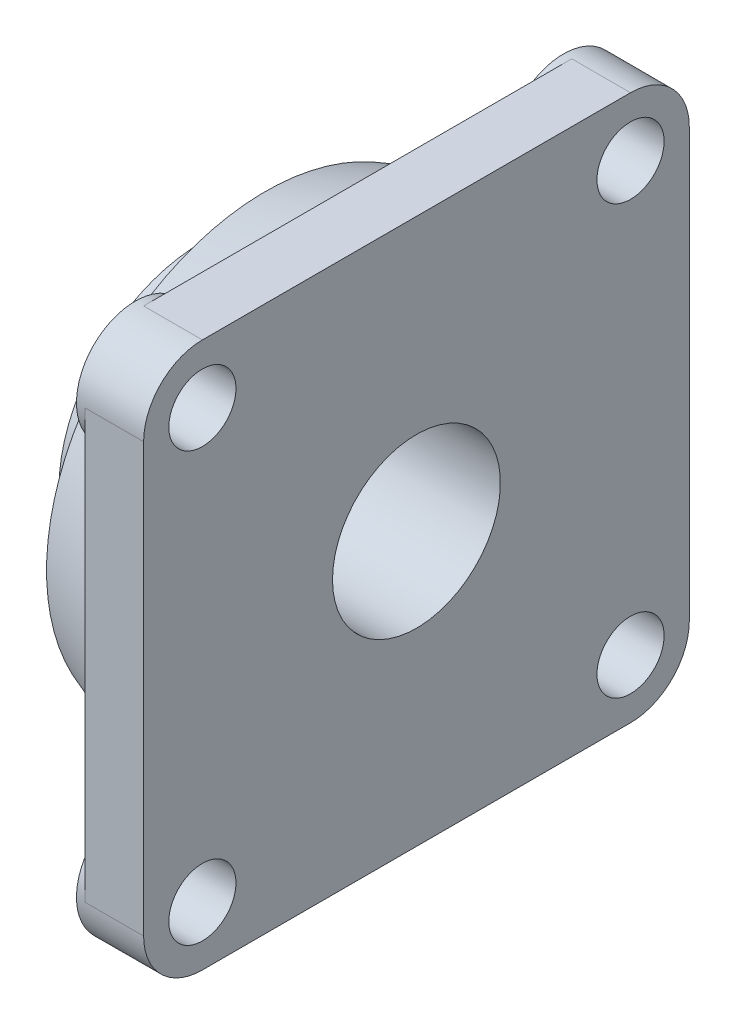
ISO-10303-21;
HEADER;
FILE_DESCRIPTION(('STEP AP214'),'2;1');
FILE_NAME('part.step','',(''),(''),'','','');
FILE_SCHEMA(('AUTOMOTIVE_DESIGN { 1 0 10303 214 1 1 1 1 }'));
ENDSEC;
DATA;
#1=APPLICATION_CONTEXT('core data for automotive mechanical design processes');
#2=APPLICATION_PROTOCOL_DEFINITION('international standard','automotive_design',2000,#1);
#3=PRODUCT_CONTEXT('',#1,'mechanical');
#4=PRODUCT('Part','Part','',(#3));
#5=PRODUCT_RELATED_PRODUCT_CATEGORY('part','',(#4));
#6=PRODUCT_DEFINITION_FORMATION('','',#4);
#7=PRODUCT_DEFINITION_CONTEXT('part definition',#1,'design');
#8=PRODUCT_DEFINITION('design','',#6,#7);
#9=PRODUCT_DEFINITION_SHAPE('','',#8);
#10=(LENGTH_UNIT() NAMED_UNIT(*) SI_UNIT(.MILLI.,.METRE.));
#11=(NAMED_UNIT(*) PLANE_ANGLE_UNIT() SI_UNIT($,.RADIAN.));
#12=(NAMED_UNIT(*) SI_UNIT($,.STERADIAN.) SOLID_ANGLE_UNIT());
#13=UNCERTAINTY_MEASURE_WITH_UNIT(LENGTH_MEASURE(1.E-05),#10,'distance_accuracy_value','');
#14=(GEOMETRIC_REPRESENTATION_CONTEXT(3) GLOBAL_UNCERTAINTY_ASSIGNED_CONTEXT((#13)) GLOBAL_UNIT_ASSIGNED_CONTEXT((#10,
#11,#12)) REPRESENTATION_CONTEXT('',''));
#15=CARTESIAN_POINT('',(0.,0.,0.));
#16=DIRECTION('',(0.,0.,1.));
#17=DIRECTION('',(1.,0.,0.));
#18=AXIS2_PLACEMENT_3D('',#15,#16,#17);
#19=CARTESIAN_POINT('',(-16.,-30.922499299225,60.5842271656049));
#20=CARTESIAN_POINT('',(-16.,-30.922499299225,59.5443088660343));
#21=CARTESIAN_POINT('',(-16.,-30.922499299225,59.4042963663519));
#22=CARTESIAN_POINT('',(-16.,-30.922499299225,45.4030463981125));
#23=B_SPLINE_CURVE_WITH_KNOTS('',1,(#19,#20,#21,#22),.UNSPECIFIED.,.F.,.F.,(2,1,1,2),
(-0.0842732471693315,-0.01,0.,1.),.UNSPECIFIED.);
#24=DIRECTION('',(0.,1.,0.));
#25=VECTOR('',#24,1.);
#26=SURFACE_OF_LINEAR_EXTRUSION('',#23,#25);
#27=CARTESIAN_POINT('',(-16.,0.,0.));
#28=DIRECTION('',(1.,0.,0.));
#29=DIRECTION('',(0.,1.,0.));
#30=AXIS2_PLACEMENT_3D('',#27,#28,#29);
#31=CIRCLE('',#30,52.1248916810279);
#32=CARTESIAN_POINT('',(-16.,25.6040565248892,45.4030463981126));
#33=VERTEX_POINT('',#32);
#34=CARTESIAN_POINT('',(-16.,-25.6040565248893,45.4030463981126));
#35=VERTEX_POINT('',#34);
#36=EDGE_CURVE('E20',#33,#35,#31,.T.);
#37=ORIENTED_EDGE('',*,*,#36,.F.);
#38=DIRECTION('',(0.,-0.707106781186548,-0.707106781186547));
#39=VECTOR('',#38,1.);
#40=CARTESIAN_POINT('',(-16.,33.3522807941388,53.1512706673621));
#41=LINE('',#40,#39);
#42=CARTESIAN_POINT('',(-16.,30.9224994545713,50.7214893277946));
#43=VERTEX_POINT('',#42);
#44=EDGE_CURVE('E234',#43,#33,#41,.T.);
#45=ORIENTED_EDGE('',*,*,#44,.F.);
#46=CARTESIAN_POINT('',(-16.,0.,0.));
#47=DIRECTION('',(1.,0.,0.));
#48=DIRECTION('',(0.,0.,-1.));
#49=AXIS2_PLACEMENT_3D('',#46,#47,#48);
#50=CIRCLE('',#49,59.4042963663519);
#51=CARTESIAN_POINT('',(-16.,-30.922499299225,50.7214891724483));
#52=VERTEX_POINT('',#51);
#53=EDGE_CURVE('E213',#52,#43,#50,.F.);
#54=ORIENTED_EDGE('',*,*,#53,.F.);
#55=DIRECTION('',(0.,-0.707106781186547,0.707106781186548));
#56=VECTOR('',#55,1.);
#57=CARTESIAN_POINT('',(-16.,-33.3522807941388,53.1512706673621));
#58=LINE('',#57,#56);
#59=EDGE_CURVE('E211',#35,#52,#58,.T.);
#60=ORIENTED_EDGE('',*,*,#59,.F.);
#61=EDGE_LOOP('',(#37,#45,#54,#60));
#62=FACE_BOUND('',#61,.T.);
#63=ADVANCED_FACE('F16',(#62),#26,.T.);
#64=CARTESIAN_POINT('',(-14.,0.,0.));
#65=DIRECTION('',(1.,0.,0.));
#66=DIRECTION('',(0.,1.,0.));
#67=AXIS2_PLACEMENT_3D('',#64,#65,#66);
#68=CYLINDRICAL_SURFACE('',#67,52.1248916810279);
#69=ORIENTED_EDGE('',*,*,#36,.T.);
#70=DIRECTION('',(1.,0.,0.));
#71=VECTOR('',#70,1.);
#72=CARTESIAN_POINT('',(-16.,-25.6040565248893,45.4030463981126));
#73=LINE('',#72,#71);
#74=CARTESIAN_POINT('',(-14.,-25.6040565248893,45.4030463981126));
#75=VERTEX_POINT('',#74);
#76=EDGE_CURVE('E205',#75,#35,#73,.F.);
#77=ORIENTED_EDGE('',*,*,#76,.F.);
#78=CARTESIAN_POINT('',(-14.,0.,0.));
#79=DIRECTION('',(1.,0.,0.));
#80=DIRECTION('',(0.,1.,0.));
#81=AXIS2_PLACEMENT_3D('',#78,#79,#80);
#82=CIRCLE('',#81,52.1248916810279);
#83=CARTESIAN_POINT('',(-14.,25.6040565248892,45.4030463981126));
#84=VERTEX_POINT('',#83);
#85=EDGE_CURVE('E375',#84,#75,#82,.T.);
#86=ORIENTED_EDGE('',*,*,#85,.F.);
#87=DIRECTION('',(1.,0.,0.));
#88=VECTOR('',#87,1.);
#89=CARTESIAN_POINT('',(-16.,25.6040565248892,45.4030463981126));
#90=LINE('',#89,#88);
#91=EDGE_CURVE('E207',#33,#84,#90,.T.);
#92=ORIENTED_EDGE('',*,*,#91,.F.);
#93=EDGE_LOOP('',(#69,#77,#86,#92));
#94=FACE_BOUND('',#93,.T.);
#95=ADVANCED_FACE('F202',(#94),#68,.T.);
#96=CARTESIAN_POINT('',(-16.,-59.4883038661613,30.922499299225));
#97=DIRECTION('',(1.,0.,0.));
#98=DIRECTION('',(0.,0.,-1.));
#99=AXIS2_PLACEMENT_3D('',#96,#97,#98);
#100=PLANE('',#99);
#101=DIRECTION('',(0.,0.707106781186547,-0.707106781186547));
#102=VECTOR('',#101,1.);
#103=CARTESIAN_POINT('',(-16.,-53.1512706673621,33.3522807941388));
#104=LINE('',#103,#102);
#105=CARTESIAN_POINT('',(-16.,-50.7214891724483,30.922499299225));
#106=VERTEX_POINT('',#105);
#107=CARTESIAN_POINT('',(-16.,-45.4030463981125,25.6040565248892));
#108=VERTEX_POINT('',#107);
#109=EDGE_CURVE('E415',#106,#108,#104,.T.);
#110=ORIENTED_EDGE('',*,*,#109,.F.);
#111=CARTESIAN_POINT('',(-16.,0.,0.));
#112=DIRECTION('',(1.,0.,0.));
#113=DIRECTION('',(0.,0.,-1.));
#114=AXIS2_PLACEMENT_3D('',#111,#112,#113);
#115=CIRCLE('',#114,59.4042963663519);
#116=CARTESIAN_POINT('',(-16.,-50.7214891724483,-30.9224992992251));
#117=VERTEX_POINT('',#116);
#118=EDGE_CURVE('E381',#117,#106,#115,.F.);
#119=ORIENTED_EDGE('',*,*,#118,.F.);
#120=DIRECTION('',(0.,-0.707106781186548,-0.707106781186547));
#121=VECTOR('',#120,1.);
#122=CARTESIAN_POINT('',(-16.,-53.1512706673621,-33.3522807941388));
#123=LINE('',#122,#121);
#124=CARTESIAN_POINT('',(-16.,-45.4030463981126,-25.6040565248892));
#125=VERTEX_POINT('',#124);
#126=EDGE_CURVE('E401',#125,#117,#123,.T.);
#127=ORIENTED_EDGE('',*,*,#126,.F.);
#128=CARTESIAN_POINT('',(-16.,0.,0.));
#129=DIRECTION('',(1.,0.,0.));
#130=DIRECTION('',(0.,0.,-1.));
#131=AXIS2_PLACEMENT_3D('',#128,#129,#130);
#132=CIRCLE('',#131,52.1248916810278);
#133=EDGE_CURVE('E209',#108,#125,#132,.T.);
#134=ORIENTED_EDGE('',*,*,#133,.F.);
#135=EDGE_LOOP('',(#110,#119,#127,#134));
#136=FACE_BOUND('',#135,.T.);
#137=ADVANCED_FACE('F402',(#136),#100,.T.);
#138=CARTESIAN_POINT('',(-14.,0.,0.));
#139=DIRECTION('',(1.,0.,0.));
#140=DIRECTION('',(0.,0.,-1.));
#141=AXIS2_PLACEMENT_3D('',#138,#139,#140);
#142=CYLINDRICAL_SURFACE('',#141,52.1248916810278);
#143=ORIENTED_EDGE('',*,*,#133,.T.);
#144=DIRECTION('',(1.,0.,0.));
#145=VECTOR('',#144,1.);
#146=CARTESIAN_POINT('',(-16.,-45.4030463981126,-25.6040565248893));
#147=LINE('',#146,#145);
#148=CARTESIAN_POINT('',(-14.,-45.4030463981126,-25.6040565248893));
#149=VERTEX_POINT('',#148);
#150=EDGE_CURVE('E388',#149,#125,#147,.F.);
#151=ORIENTED_EDGE('',*,*,#150,.F.);
#152=CARTESIAN_POINT('',(-14.,0.,0.));
#153=DIRECTION('',(1.,0.,0.));
#154=DIRECTION('',(0.,0.,-1.));
#155=AXIS2_PLACEMENT_3D('',#152,#153,#154);
#156=CIRCLE('',#155,52.1248916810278);
#157=CARTESIAN_POINT('',(-14.,-45.4030463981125,25.6040565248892));
#158=VERTEX_POINT('',#157);
#159=EDGE_CURVE('E367',#158,#149,#156,.T.);
#160=ORIENTED_EDGE('',*,*,#159,.F.);
#161=DIRECTION('',(1.,0.,0.));
#162=VECTOR('',#161,1.);
#163=CARTESIAN_POINT('',(-16.,-45.4030463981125,25.6040565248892));
#164=LINE('',#163,#162);
#165=EDGE_CURVE('E397',#108,#158,#164,.T.);
#166=ORIENTED_EDGE('',*,*,#165,.F.);
#167=EDGE_LOOP('',(#143,#151,#160,#166));
#168=FACE_BOUND('',#167,.T.);
#169=ADVANCED_FACE('F393',(#168),#142,.T.);
#170=CARTESIAN_POINT('',(-16.,-30.922499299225,-45.4030463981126));
#171=CARTESIAN_POINT('',(-16.,-30.922499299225,-59.4042963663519));
#172=CARTESIAN_POINT('',(-16.,-30.922499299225,-59.5443088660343));
#173=CARTESIAN_POINT('',(-16.,-30.922499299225,-60.5842271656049));
#174=B_SPLINE_CURVE_WITH_KNOTS('',1,(#170,#171,#172,#173),.UNSPECIFIED.,.F.,.F.,(2,1,1,2),(0.,
1.,1.01,1.08427324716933),.UNSPECIFIED.);
#175=DIRECTION('',(0.,1.,0.));
#176=VECTOR('',#175,1.);
#177=SURFACE_OF_LINEAR_EXTRUSION('',#174,#176);
#178=CARTESIAN_POINT('',(-16.,0.,0.));
#179=DIRECTION('',(1.,0.,0.));
#180=DIRECTION('',(0.,1.,0.));
#181=AXIS2_PLACEMENT_3D('',#178,#179,#180);
#182=CIRCLE('',#181,52.1248916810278);
#183=CARTESIAN_POINT('',(-16.,-25.6040565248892,-45.4030463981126));
#184=VERTEX_POINT('',#183);
#185=CARTESIAN_POINT('',(-16.,25.6040565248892,-45.4030463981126));
#186=VERTEX_POINT('',#185);
#187=EDGE_CURVE('E389',#184,#186,#182,.T.);
#188=ORIENTED_EDGE('',*,*,#187,.F.);
#189=DIRECTION('',(0.,0.707106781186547,0.707106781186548));
#190=VECTOR('',#189,1.);
#191=CARTESIAN_POINT('',(-16.,-33.3522807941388,-53.1512706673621));
#192=LINE('',#191,#190);
#193=CARTESIAN_POINT('',(-16.,-30.9224993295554,-50.7214892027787));
#194=VERTEX_POINT('',#193);
#195=EDGE_CURVE('E715',#194,#184,#192,.T.);
#196=ORIENTED_EDGE('',*,*,#195,.F.);
#197=CARTESIAN_POINT('',(-16.,0.,0.));
#198=DIRECTION('',(1.,0.,0.));
#199=DIRECTION('',(0.,0.,-1.));
#200=AXIS2_PLACEMENT_3D('',#197,#198,#199);
#201=CIRCLE('',#200,59.4042963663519);
#202=CARTESIAN_POINT('',(-16.,30.922499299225,-50.7214891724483));
#203=VERTEX_POINT('',#202);
#204=EDGE_CURVE('E217',#203,#194,#201,.F.);
#205=ORIENTED_EDGE('',*,*,#204,.F.);
#206=DIRECTION('',(0.,0.707106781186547,-0.707106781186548));
#207=VECTOR('',#206,1.);
#208=CARTESIAN_POINT('',(-16.,33.3522807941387,-53.1512706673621));
#209=LINE('',#208,#207);
#210=EDGE_CURVE('E524',#186,#203,#209,.T.);
#211=ORIENTED_EDGE('',*,*,#210,.F.);
#212=EDGE_LOOP('',(#188,#196,#205,#211));
#213=FACE_BOUND('',#212,.T.);
#214=ADVANCED_FACE('F730',(#213),#177,.T.);
#215=CARTESIAN_POINT('',(-14.,0.,0.));
#216=DIRECTION('',(1.,0.,0.));
#217=DIRECTION('',(0.,1.,0.));
#218=AXIS2_PLACEMENT_3D('',#215,#216,#217);
#219=CYLINDRICAL_SURFACE('',#218,52.1248916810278);
#220=ORIENTED_EDGE('',*,*,#187,.T.);
#221=DIRECTION('',(1.,0.,0.));
#222=VECTOR('',#221,1.);
#223=CARTESIAN_POINT('',(-16.,25.6040565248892,-45.4030463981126));
#224=LINE('',#223,#222);
#225=CARTESIAN_POINT('',(-14.,25.6040565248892,-45.4030463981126));
#226=VERTEX_POINT('',#225);
#227=EDGE_CURVE('E406',#226,#186,#224,.F.);
#228=ORIENTED_EDGE('',*,*,#227,.F.);
#229=CARTESIAN_POINT('',(-14.,0.,0.));
#230=DIRECTION('',(1.,0.,0.));
#231=DIRECTION('',(0.,1.,0.));
#232=AXIS2_PLACEMENT_3D('',#229,#230,#231);
#233=CIRCLE('',#232,52.1248916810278);
#234=CARTESIAN_POINT('',(-14.,-25.6040565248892,-45.4030463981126));
#235=VERTEX_POINT('',#234);
#236=EDGE_CURVE('E358',#235,#226,#233,.T.);
#237=ORIENTED_EDGE('',*,*,#236,.F.);
#238=DIRECTION('',(1.,0.,0.));
#239=VECTOR('',#238,1.);
#240=CARTESIAN_POINT('',(-16.,-25.6040565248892,-45.4030463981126));
#241=LINE('',#240,#239);
#242=EDGE_CURVE('E558',#184,#235,#241,.T.);
#243=ORIENTED_EDGE('',*,*,#242,.F.);
#244=EDGE_LOOP('',(#220,#228,#237,#243));
#245=FACE_BOUND('',#244,.T.);
#246=ADVANCED_FACE('F701',(#245),#219,.T.);
#247=CARTESIAN_POINT('',(-16.,45.3190388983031,30.922499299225));
#248=DIRECTION('',(1.,0.,0.));
#249=DIRECTION('',(0.,0.,-1.));
#250=AXIS2_PLACEMENT_3D('',#247,#248,#249);
#251=PLANE('',#250);
#252=DIRECTION('',(0.,-0.707106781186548,0.707106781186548));
#253=VECTOR('',#252,1.);
#254=CARTESIAN_POINT('',(-16.,53.1512706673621,-33.3522807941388));
#255=LINE('',#254,#253);
#256=CARTESIAN_POINT('',(-16.,50.7214891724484,-30.922499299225));
#257=VERTEX_POINT('',#256);
#258=CARTESIAN_POINT('',(-16.,45.4030463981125,-25.6040565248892));
#259=VERTEX_POINT('',#258);
#260=EDGE_CURVE('E527',#257,#259,#255,.T.);
#261=ORIENTED_EDGE('',*,*,#260,.F.);
#262=CARTESIAN_POINT('',(-16.,0.,0.));
#263=DIRECTION('',(1.,0.,0.));
#264=DIRECTION('',(0.,0.,-1.));
#265=AXIS2_PLACEMENT_3D('',#262,#263,#264);
#266=CIRCLE('',#265,59.4042963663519);
#267=CARTESIAN_POINT('',(-16.,50.7214891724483,30.922499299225));
#268=VERTEX_POINT('',#267);
#269=EDGE_CURVE('E377',#268,#257,#266,.F.);
#270=ORIENTED_EDGE('',*,*,#269,.F.);
#271=DIRECTION('',(0.,0.707106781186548,0.707106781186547));
#272=VECTOR('',#271,1.);
#273=CARTESIAN_POINT('',(-16.,53.1512706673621,33.3522807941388));
#274=LINE('',#273,#272);
#275=CARTESIAN_POINT('',(-16.,45.4030463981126,25.6040565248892));
#276=VERTEX_POINT('',#275);
#277=EDGE_CURVE('E223',#276,#268,#274,.T.);
#278=ORIENTED_EDGE('',*,*,#277,.F.);
#279=CARTESIAN_POINT('',(-16.,0.,0.));
#280=DIRECTION('',(1.,0.,0.));
#281=DIRECTION('',(0.,0.,-1.));
#282=AXIS2_PLACEMENT_3D('',#279,#280,#281);
#283=CIRCLE('',#282,52.1248916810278);
#284=EDGE_CURVE('E386',#259,#276,#283,.T.);
#285=ORIENTED_EDGE('',*,*,#284,.F.);
#286=EDGE_LOOP('',(#261,#270,#278,#285));
#287=FACE_BOUND('',#286,.T.);
#288=ADVANCED_FACE('F830',(#287),#251,.T.);
#289=CARTESIAN_POINT('',(-14.,0.,0.));
#290=DIRECTION('',(1.,0.,0.));
#291=DIRECTION('',(0.,0.,-1.));
#292=AXIS2_PLACEMENT_3D('',#289,#290,#291);
#293=CYLINDRICAL_SURFACE('',#292,52.1248916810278);
#294=ORIENTED_EDGE('',*,*,#284,.T.);
#295=DIRECTION('',(1.,0.,0.));
#296=VECTOR('',#295,1.);
#297=CARTESIAN_POINT('',(-16.,45.4030463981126,25.6040565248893));
#298=LINE('',#297,#296);
#299=CARTESIAN_POINT('',(-14.,45.4030463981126,25.6040565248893));
#300=VERTEX_POINT('',#299);
#301=EDGE_CURVE('E226',#300,#276,#298,.F.);
#302=ORIENTED_EDGE('',*,*,#301,.F.);
#303=CARTESIAN_POINT('',(-14.,0.,0.));
#304=DIRECTION('',(1.,0.,0.));
#305=DIRECTION('',(0.,0.,-1.));
#306=AXIS2_PLACEMENT_3D('',#303,#304,#305);
#307=CIRCLE('',#306,52.1248916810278);
#308=CARTESIAN_POINT('',(-14.,45.4030463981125,-25.6040565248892));
#309=VERTEX_POINT('',#308);
#310=EDGE_CURVE('E349',#309,#300,#307,.T.);
#311=ORIENTED_EDGE('',*,*,#310,.F.);
#312=DIRECTION('',(1.,0.,0.));
#313=VECTOR('',#312,1.);
#314=CARTESIAN_POINT('',(-16.,45.4030463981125,-25.6040565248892));
#315=LINE('',#314,#313);
#316=EDGE_CURVE('E525',#259,#309,#315,.T.);
#317=ORIENTED_EDGE('',*,*,#316,.F.);
#318=EDGE_LOOP('',(#294,#302,#311,#317));
#319=FACE_BOUND('',#318,.T.);
#320=ADVANCED_FACE('F828',(#319),#293,.T.);
#321=CARTESIAN_POINT('',(-16.,-45.4030463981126,-25.6040565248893));
#322=DIRECTION('',(0.,-0.707106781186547,0.707106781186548));
#323=DIRECTION('',(0.,-0.707106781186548,-0.707106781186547));
#324=AXIS2_PLACEMENT_3D('',#321,#322,#323);
#325=PLANE('',#324);
#326=CARTESIAN_POINT('',(-16.,-60.8994949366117,-41.1005050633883));
#327=CARTESIAN_POINT('',(-16.,-60.4754113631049,-40.6764214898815));
#328=CARTESIAN_POINT('',(-16.,-60.051327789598,-40.2523379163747));
#329=CARTESIAN_POINT('',(-16.,-59.2031606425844,-39.4041707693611));
#330=CARTESIAN_POINT('',(-16.,-58.7790770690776,-38.9800871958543));
#331=CARTESIAN_POINT('',(-16.,-57.930909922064,-38.1319200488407));
#332=CARTESIAN_POINT('',(-16.,-57.5068263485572,-37.7078364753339));
#333=CARTESIAN_POINT('',(-16.,-56.6586592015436,-36.8596693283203));
#334=CARTESIAN_POINT('',(-16.,-56.2345756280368,-36.4355857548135));
#335=CARTESIAN_POINT('',(-16.,-55.3864084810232,-35.5874186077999));
#336=CARTESIAN_POINT('',(-16.,-54.9623249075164,-35.1633350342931));
#337=CARTESIAN_POINT('',(-16.,-54.1141577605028,-34.3151678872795));
#338=CARTESIAN_POINT('',(-16.,-53.690074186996,-33.8910843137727));
#339=CARTESIAN_POINT('',(-16.,-52.8419070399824,-33.042917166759));
#340=CARTESIAN_POINT('',(-16.,-52.4178234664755,-32.6188335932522));
#341=CARTESIAN_POINT('',(-16.,-51.5696563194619,-31.7706664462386));
#342=CARTESIAN_POINT('',(-16.,-51.1455727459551,-31.3465828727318));
#343=CARTESIAN_POINT('',(-16.,-50.7214891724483,-30.922499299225));
#344=B_SPLINE_CURVE_WITH_KNOTS('',3,(#326,#327,#328,#329,#330,#331,#332,#333,#334,#335,#336,
#337,#338,#339,#340,#341,#342,#343),.UNSPECIFIED.,.F.,.F.,(4,2,2,2,2,2,2,2,4),(0.,
1.79923422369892,3.59846844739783,5.39770267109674,7.19693689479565,8.99617111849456,
10.7954053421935,12.5946395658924,14.3938737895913),.UNSPECIFIED.);
#345=CARTESIAN_POINT('',(-16.,-60.8994949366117,-41.1005050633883));
#346=VERTEX_POINT('',#345);
#347=EDGE_CURVE('E345',#346,#117,#344,.T.);
#348=ORIENTED_EDGE('',*,*,#347,.F.);
#349=DIRECTION('',(-1.,0.,0.));
#350=VECTOR('',#349,1.);
#351=CARTESIAN_POINT('',(-15.,-60.8994949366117,-41.1005050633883));
#352=LINE('',#351,#350);
#353=CARTESIAN_POINT('',(-14.,-60.8994949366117,-41.1005050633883));
#354=VERTEX_POINT('',#353);
#355=EDGE_CURVE('E365',#354,#346,#352,.T.);
#356=ORIENTED_EDGE('',*,*,#355,.F.);
#357=CARTESIAN_POINT('',(-14.,-45.4030463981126,-25.6040565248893));
#358=CARTESIAN_POINT('',(-14.,-46.0487317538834,-26.24974188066));
#359=CARTESIAN_POINT('',(-14.,-46.6944171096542,-26.8954272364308));
#360=CARTESIAN_POINT('',(-14.,-47.9857878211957,-28.1867979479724));
#361=CARTESIAN_POINT('',(-14.,-48.6314731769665,-28.8324833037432));
#362=CARTESIAN_POINT('',(-14.,-49.9228438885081,-30.1238540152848));
#363=CARTESIAN_POINT('',(-14.,-50.5685292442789,-30.7695393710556));
#364=CARTESIAN_POINT('',(-14.,-51.8598999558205,-32.0609100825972));
#365=CARTESIAN_POINT('',(-14.,-52.5055853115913,-32.706595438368));
#366=CARTESIAN_POINT('',(-14.,-53.7969560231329,-33.9979661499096));
#367=CARTESIAN_POINT('',(-14.,-54.4426413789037,-34.6436515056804));
#368=CARTESIAN_POINT('',(-14.,-55.7340120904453,-35.935022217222));
#369=CARTESIAN_POINT('',(-14.,-56.3796974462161,-36.5807075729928));
#370=CARTESIAN_POINT('',(-14.,-57.6710681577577,-37.8720782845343));
#371=CARTESIAN_POINT('',(-14.,-58.3167535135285,-38.5177636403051));
#372=CARTESIAN_POINT('',(-14.,-59.6081242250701,-39.8091343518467));
#373=CARTESIAN_POINT('',(-14.,-60.2538095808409,-40.4548197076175));
#374=CARTESIAN_POINT('',(-14.,-60.8994949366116,-41.1005050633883));
#375=B_SPLINE_CURVE_WITH_KNOTS('',3,(#357,#358,#359,#360,#361,#362,#363,#364,#365,#366,#367,
#368,#369,#370,#371,#372,#373,#374),.UNSPECIFIED.,.F.,.F.,(4,2,2,2,2,2,2,2,4),(0.,
2.73941096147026,5.47882192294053,8.21823288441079,10.9576438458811,13.6970548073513,
16.4364657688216,19.1758767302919,21.9152876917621),.UNSPECIFIED.);
#376=EDGE_CURVE('E366',#149,#354,#375,.T.);
#377=ORIENTED_EDGE('',*,*,#376,.F.);
#378=ORIENTED_EDGE('',*,*,#150,.T.);
#379=ORIENTED_EDGE('',*,*,#126,.T.);
#380=EDGE_LOOP('',(#348,#356,#377,#378,#379));
#381=FACE_BOUND('',#380,.T.);
#382=ADVANCED_FACE('F408',(#381),#325,.T.);
#383=CARTESIAN_POINT('',(-16.,25.6040565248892,-45.4030463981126));
#384=DIRECTION('',(0.,-0.707106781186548,-0.707106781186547));
#385=DIRECTION('',(0.,0.707106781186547,-0.707106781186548));
#386=AXIS2_PLACEMENT_3D('',#383,#384,#385);
#387=PLANE('',#386);
#388=CARTESIAN_POINT('',(-16.,41.1005050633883,-60.8994949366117));
#389=CARTESIAN_POINT('',(-16.,40.6764214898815,-60.4754113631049));
#390=CARTESIAN_POINT('',(-16.,40.2523379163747,-60.0513277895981));
#391=CARTESIAN_POINT('',(-16.,39.4041707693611,-59.2031606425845));
#392=CARTESIAN_POINT('',(-16.,38.9800871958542,-58.7790770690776));
#393=CARTESIAN_POINT('',(-16.,38.1319200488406,-57.930909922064));
#394=CARTESIAN_POINT('',(-16.,37.7078364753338,-57.5068263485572));
#395=CARTESIAN_POINT('',(-16.,36.8596693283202,-56.6586592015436));
#396=CARTESIAN_POINT('',(-16.,36.4355857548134,-56.2345756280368));
#397=CARTESIAN_POINT('',(-16.,35.5874186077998,-55.3864084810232));
#398=CARTESIAN_POINT('',(-16.,35.163335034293,-54.9623249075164));
#399=CARTESIAN_POINT('',(-16.,34.3151678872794,-54.1141577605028));
#400=CARTESIAN_POINT('',(-16.,33.8910843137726,-53.690074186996));
#401=CARTESIAN_POINT('',(-16.,33.042917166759,-52.8419070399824));
#402=CARTESIAN_POINT('',(-16.,32.6188335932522,-52.4178234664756));
#403=CARTESIAN_POINT('',(-16.,31.7706664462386,-51.569656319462));
#404=CARTESIAN_POINT('',(-16.,31.3465828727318,-51.1455727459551));
#405=CARTESIAN_POINT('',(-16.,30.922499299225,-50.7214891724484));
#406=B_SPLINE_CURVE_WITH_KNOTS('',3,(#388,#389,#390,#391,#392,#393,#394,#395,#396,#397,#398,
#399,#400,#401,#402,#403,#404,#405),.UNSPECIFIED.,.F.,.F.,(4,2,2,2,2,2,2,2,4),(0.,
1.79923422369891,3.59846844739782,5.39770267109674,7.19693689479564,8.99617111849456,
10.7954053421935,12.5946395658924,14.3938737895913),.UNSPECIFIED.);
#407=CARTESIAN_POINT('',(-16.,41.1005050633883,-60.8994949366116));
#408=VERTEX_POINT('',#407);
#409=EDGE_CURVE('E340',#408,#203,#406,.T.);
#410=ORIENTED_EDGE('',*,*,#409,.F.);
#411=DIRECTION('',(-1.,0.,0.));
#412=VECTOR('',#411,1.);
#413=CARTESIAN_POINT('',(-15.,41.1005050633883,-60.8994949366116));
#414=LINE('',#413,#412);
#415=CARTESIAN_POINT('',(-14.,41.1005050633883,-60.8994949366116));
#416=VERTEX_POINT('',#415);
#417=EDGE_CURVE('E356',#416,#408,#414,.T.);
#418=ORIENTED_EDGE('',*,*,#417,.F.);
#419=CARTESIAN_POINT('',(-14.,25.6040565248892,-45.4030463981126));
#420=CARTESIAN_POINT('',(-14.,26.24974188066,-46.0487317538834));
#421=CARTESIAN_POINT('',(-14.,26.8954272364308,-46.6944171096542));
#422=CARTESIAN_POINT('',(-14.,28.1867979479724,-47.9857878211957));
#423=CARTESIAN_POINT('',(-14.,28.8324833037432,-48.6314731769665));
#424=CARTESIAN_POINT('',(-14.,30.1238540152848,-49.9228438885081));
#425=CARTESIAN_POINT('',(-14.,30.7695393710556,-50.5685292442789));
#426=CARTESIAN_POINT('',(-14.,32.0609100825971,-51.8598999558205));
#427=CARTESIAN_POINT('',(-14.,32.706595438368,-52.5055853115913));
#428=CARTESIAN_POINT('',(-14.,33.9979661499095,-53.7969560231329));
#429=CARTESIAN_POINT('',(-14.,34.6436515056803,-54.4426413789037));
#430=CARTESIAN_POINT('',(-14.,35.9350222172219,-55.7340120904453));
#431=CARTESIAN_POINT('',(-14.,36.5807075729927,-56.3796974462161));
#432=CARTESIAN_POINT('',(-14.,37.8720782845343,-57.6710681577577));
#433=CARTESIAN_POINT('',(-14.,38.5177636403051,-58.3167535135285));
#434=CARTESIAN_POINT('',(-14.,39.8091343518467,-59.6081242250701));
#435=CARTESIAN_POINT('',(-14.,40.4548197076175,-60.2538095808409));
#436=CARTESIAN_POINT('',(-14.,41.1005050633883,-60.8994949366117));
#437=B_SPLINE_CURVE_WITH_KNOTS('',3,(#419,#420,#421,#422,#423,#424,#425,#426,#427,#428,#429,
#430,#431,#432,#433,#434,#435,#436),.UNSPECIFIED.,.F.,.F.,(4,2,2,2,2,2,2,2,4),(0.,
2.73941096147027,5.47882192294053,8.21823288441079,10.9576438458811,13.6970548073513,
16.4364657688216,19.1758767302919,21.9152876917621),.UNSPECIFIED.);
#438=EDGE_CURVE('E357',#226,#416,#437,.T.);
#439=ORIENTED_EDGE('',*,*,#438,.F.);
#440=ORIENTED_EDGE('',*,*,#227,.T.);
#441=ORIENTED_EDGE('',*,*,#210,.T.);
#442=EDGE_LOOP('',(#410,#418,#439,#440,#441));
#443=FACE_BOUND('',#442,.T.);
#444=ADVANCED_FACE('F707',(#443),#387,.T.);
#445=CARTESIAN_POINT('',(-16.,45.4030463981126,25.6040565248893));
#446=DIRECTION('',(0.,0.707106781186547,-0.707106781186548));
#447=DIRECTION('',(0.,0.707106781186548,0.707106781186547));
#448=AXIS2_PLACEMENT_3D('',#445,#446,#447);
#449=PLANE('',#448);
#450=CARTESIAN_POINT('',(-16.,60.8994949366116,41.1005050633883));
#451=CARTESIAN_POINT('',(-16.,60.4754113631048,40.6764214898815));
#452=CARTESIAN_POINT('',(-16.,60.051327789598,40.2523379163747));
#453=CARTESIAN_POINT('',(-16.,59.2031606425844,39.4041707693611));
#454=CARTESIAN_POINT('',(-16.,58.7790770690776,38.9800871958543));
#455=CARTESIAN_POINT('',(-16.,57.930909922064,38.1319200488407));
#456=CARTESIAN_POINT('',(-16.,57.5068263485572,37.7078364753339));
#457=CARTESIAN_POINT('',(-16.,56.6586592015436,36.8596693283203));
#458=CARTESIAN_POINT('',(-16.,56.2345756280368,36.4355857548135));
#459=CARTESIAN_POINT('',(-16.,55.3864084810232,35.5874186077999));
#460=CARTESIAN_POINT('',(-16.,54.9623249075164,35.1633350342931));
#461=CARTESIAN_POINT('',(-16.,54.1141577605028,34.3151678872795));
#462=CARTESIAN_POINT('',(-16.,53.690074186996,33.8910843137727));
#463=CARTESIAN_POINT('',(-16.,52.8419070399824,33.042917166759));
#464=CARTESIAN_POINT('',(-16.,52.4178234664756,32.6188335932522));
#465=CARTESIAN_POINT('',(-16.,51.569656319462,31.7706664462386));
#466=CARTESIAN_POINT('',(-16.,51.1455727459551,31.3465828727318));
#467=CARTESIAN_POINT('',(-16.,50.7214891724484,30.922499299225));
#468=B_SPLINE_CURVE_WITH_KNOTS('',3,(#450,#451,#452,#453,#454,#455,#456,#457,#458,#459,#460,
#461,#462,#463,#464,#465,#466,#467),.UNSPECIFIED.,.F.,.F.,(4,2,2,2,2,2,2,2,4),(0.,
1.79923422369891,3.59846844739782,5.39770267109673,7.19693689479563,8.99617111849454,
10.7954053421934,12.5946395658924,14.3938737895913),.UNSPECIFIED.);
#469=CARTESIAN_POINT('',(-16.,60.8994949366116,41.1005050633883));
#470=VERTEX_POINT('',#469);
#471=EDGE_CURVE('E335',#470,#268,#468,.T.);
#472=ORIENTED_EDGE('',*,*,#471,.F.);
#473=DIRECTION('',(-1.,0.,0.));
#474=VECTOR('',#473,1.);
#475=CARTESIAN_POINT('',(-15.,60.8994949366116,41.1005050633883));
#476=LINE('',#475,#474);
#477=CARTESIAN_POINT('',(-14.,60.8994949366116,41.1005050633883));
#478=VERTEX_POINT('',#477);
#479=EDGE_CURVE('E379',#478,#470,#476,.T.);
#480=ORIENTED_EDGE('',*,*,#479,.F.);
#481=CARTESIAN_POINT('',(-14.,45.4030463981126,25.6040565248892));
#482=CARTESIAN_POINT('',(-14.,46.0487317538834,26.24974188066));
#483=CARTESIAN_POINT('',(-14.,46.6944171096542,26.8954272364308));
#484=CARTESIAN_POINT('',(-14.,47.9857878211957,28.1867979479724));
#485=CARTESIAN_POINT('',(-14.,48.6314731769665,28.8324833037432));
#486=CARTESIAN_POINT('',(-14.,49.9228438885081,30.1238540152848));
#487=CARTESIAN_POINT('',(-14.,50.5685292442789,30.7695393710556));
#488=CARTESIAN_POINT('',(-14.,51.8598999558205,32.0609100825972));
#489=CARTESIAN_POINT('',(-14.,52.5055853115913,32.706595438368));
#490=CARTESIAN_POINT('',(-14.,53.7969560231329,33.9979661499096));
#491=CARTESIAN_POINT('',(-14.,54.4426413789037,34.6436515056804));
#492=CARTESIAN_POINT('',(-14.,55.7340120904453,35.935022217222));
#493=CARTESIAN_POINT('',(-14.,56.3796974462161,36.5807075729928));
#494=CARTESIAN_POINT('',(-14.,57.6710681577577,37.8720782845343));
#495=CARTESIAN_POINT('',(-14.,58.3167535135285,38.5177636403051));
#496=CARTESIAN_POINT('',(-14.,59.6081242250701,39.8091343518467));
#497=CARTESIAN_POINT('',(-14.,60.2538095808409,40.4548197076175));
#498=CARTESIAN_POINT('',(-14.,60.8994949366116,41.1005050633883));
#499=B_SPLINE_CURVE_WITH_KNOTS('',3,(#481,#482,#483,#484,#485,#486,#487,#488,#489,#490,#491,
#492,#493,#494,#495,#496,#497,#498),.UNSPECIFIED.,.F.,.F.,(4,2,2,2,2,2,2,2,4),(0.,
2.73941096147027,5.47882192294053,8.21823288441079,10.9576438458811,13.6970548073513,
16.4364657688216,19.1758767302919,21.9152876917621),.UNSPECIFIED.);
#500=EDGE_CURVE('E348',#300,#478,#499,.T.);
#501=ORIENTED_EDGE('',*,*,#500,.F.);
#502=ORIENTED_EDGE('',*,*,#301,.T.);
#503=ORIENTED_EDGE('',*,*,#277,.T.);
#504=EDGE_LOOP('',(#472,#480,#501,#502,#503));
#505=FACE_BOUND('',#504,.T.);
#506=ADVANCED_FACE('F635',(#505),#449,.T.);
#507=CARTESIAN_POINT('',(-16.,-25.6040565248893,45.4030463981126));
#508=DIRECTION('',(0.,0.707106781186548,0.707106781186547));
#509=DIRECTION('',(0.,-0.707106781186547,0.707106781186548));
#510=AXIS2_PLACEMENT_3D('',#507,#508,#509);
#511=PLANE('',#510);
#512=CARTESIAN_POINT('',(-16.,-41.1005050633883,60.8994949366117));
#513=CARTESIAN_POINT('',(-16.,-40.6764214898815,60.4754113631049));
#514=CARTESIAN_POINT('',(-16.,-40.2523379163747,60.0513277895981));
#515=CARTESIAN_POINT('',(-16.,-39.4041707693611,59.2031606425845));
#516=CARTESIAN_POINT('',(-16.,-38.9800871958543,58.7790770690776));
#517=CARTESIAN_POINT('',(-16.,-38.1319200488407,57.930909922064));
#518=CARTESIAN_POINT('',(-16.,-37.7078364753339,57.5068263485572));
#519=CARTESIAN_POINT('',(-16.,-36.8596693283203,56.6586592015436));
#520=CARTESIAN_POINT('',(-16.,-36.4355857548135,56.2345756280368));
#521=CARTESIAN_POINT('',(-16.,-35.5874186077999,55.3864084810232));
#522=CARTESIAN_POINT('',(-16.,-35.163335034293,54.9623249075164));
#523=CARTESIAN_POINT('',(-16.,-34.3151678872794,54.1141577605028));
#524=CARTESIAN_POINT('',(-16.,-33.8910843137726,53.690074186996));
#525=CARTESIAN_POINT('',(-16.,-33.042917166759,52.8419070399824));
#526=CARTESIAN_POINT('',(-16.,-32.6188335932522,52.4178234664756));
#527=CARTESIAN_POINT('',(-16.,-31.7706664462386,51.5696563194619));
#528=CARTESIAN_POINT('',(-16.,-31.3465828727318,51.1455727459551));
#529=CARTESIAN_POINT('',(-16.,-30.922499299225,50.7214891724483));
#530=B_SPLINE_CURVE_WITH_KNOTS('',3,(#512,#513,#514,#515,#516,#517,#518,#519,#520,#521,#522,
#523,#524,#525,#526,#527,#528,#529),.UNSPECIFIED.,.F.,.F.,(4,2,2,2,2,2,2,2,4),(0.,
1.79923422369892,3.59846844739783,5.39770267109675,7.19693689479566,8.99617111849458,
10.7954053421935,12.5946395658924,14.3938737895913),.UNSPECIFIED.);
#531=CARTESIAN_POINT('',(-16.,-41.1005050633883,60.8994949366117));
#532=VERTEX_POINT('',#531);
#533=EDGE_CURVE('E331',#532,#52,#530,.T.);
#534=ORIENTED_EDGE('',*,*,#533,.F.);
#535=DIRECTION('',(-1.,0.,0.));
#536=VECTOR('',#535,1.);
#537=CARTESIAN_POINT('',(-15.,-41.1005050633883,60.8994949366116));
#538=LINE('',#537,#536);
#539=CARTESIAN_POINT('',(-14.,-41.1005050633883,60.8994949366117));
#540=VERTEX_POINT('',#539);
#541=EDGE_CURVE('E374',#540,#532,#538,.T.);
#542=ORIENTED_EDGE('',*,*,#541,.F.);
#543=CARTESIAN_POINT('',(-14.,-25.6040565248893,45.4030463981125));
#544=CARTESIAN_POINT('',(-14.,-26.2497418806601,46.0487317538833));
#545=CARTESIAN_POINT('',(-14.,-26.8954272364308,46.6944171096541));
#546=CARTESIAN_POINT('',(-14.,-28.1867979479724,47.9857878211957));
#547=CARTESIAN_POINT('',(-14.,-28.8324833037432,48.6314731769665));
#548=CARTESIAN_POINT('',(-14.,-30.1238540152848,49.9228438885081));
#549=CARTESIAN_POINT('',(-14.,-30.7695393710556,50.5685292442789));
#550=CARTESIAN_POINT('',(-14.,-32.0609100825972,51.8598999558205));
#551=CARTESIAN_POINT('',(-14.,-32.706595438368,52.5055853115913));
#552=CARTESIAN_POINT('',(-14.,-33.9979661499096,53.7969560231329));
#553=CARTESIAN_POINT('',(-14.,-34.6436515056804,54.4426413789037));
#554=CARTESIAN_POINT('',(-14.,-35.935022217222,55.7340120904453));
#555=CARTESIAN_POINT('',(-14.,-36.5807075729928,56.3796974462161));
#556=CARTESIAN_POINT('',(-14.,-37.8720782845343,57.6710681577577));
#557=CARTESIAN_POINT('',(-14.,-38.5177636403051,58.3167535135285));
#558=CARTESIAN_POINT('',(-14.,-39.8091343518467,59.6081242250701));
#559=CARTESIAN_POINT('',(-14.,-40.4548197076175,60.2538095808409));
#560=CARTESIAN_POINT('',(-14.,-41.1005050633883,60.8994949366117));
#561=B_SPLINE_CURVE_WITH_KNOTS('',3,(#543,#544,#545,#546,#547,#548,#549,#550,#551,#552,#553,
#554,#555,#556,#557,#558,#559,#560),.UNSPECIFIED.,.F.,.F.,(4,2,2,2,2,2,2,2,4),(0.,
2.73941096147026,5.47882192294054,8.2182328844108,10.9576438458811,13.6970548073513,
16.4364657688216,19.1758767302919,21.9152876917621),.UNSPECIFIED.);
#562=EDGE_CURVE('E221',#75,#540,#561,.T.);
#563=ORIENTED_EDGE('',*,*,#562,.F.);
#564=ORIENTED_EDGE('',*,*,#76,.T.);
#565=ORIENTED_EDGE('',*,*,#59,.T.);
#566=EDGE_LOOP('',(#534,#542,#563,#564,#565));
#567=FACE_BOUND('',#566,.T.);
#568=ADVANCED_FACE('F219',(#567),#511,.T.);
#569=CARTESIAN_POINT('',(-36.,0.,0.));
#570=DIRECTION('',(1.,0.,0.));
#571=DIRECTION('',(0.,0.,-1.));
#572=AXIS2_PLACEMENT_3D('',#569,#570,#571);
#573=CONICAL_SURFACE('',#572,52.1248916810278,0.349065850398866);
#574=CARTESIAN_POINT('',(-36.,0.,0.));
#575=DIRECTION('',(1.,0.,0.));
#576=DIRECTION('',(0.,0.,-1.));
#577=AXIS2_PLACEMENT_3D('',#574,#575,#576);
#578=CIRCLE('',#577,52.1248916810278);
#579=CARTESIAN_POINT('',(-36.,0.,-52.1248916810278));
#580=VERTEX_POINT('',#579);
#581=EDGE_CURVE('E324',#580,#580,#578,.F.);
#582=ORIENTED_EDGE('',*,*,#581,.F.);
#583=EDGE_LOOP('',(#582));
#584=FACE_BOUND('',#583,.T.);
#585=CARTESIAN_POINT('',(-16.,0.,0.));
#586=DIRECTION('',(1.,0.,0.));
#587=DIRECTION('',(0.,0.,-1.));
#588=AXIS2_PLACEMENT_3D('',#585,#586,#587);
#589=CIRCLE('',#588,59.4042963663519);
#590=EDGE_CURVE('E332',#268,#43,#589,.T.);
#591=ORIENTED_EDGE('',*,*,#590,.F.);
#592=ORIENTED_EDGE('',*,*,#269,.T.);
#593=CARTESIAN_POINT('',(-16.,0.,0.));
#594=DIRECTION('',(1.,0.,0.));
#595=DIRECTION('',(0.,0.,-1.));
#596=AXIS2_PLACEMENT_3D('',#593,#594,#595);
#597=CIRCLE('',#596,59.4042963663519);
#598=EDGE_CURVE('E336',#203,#257,#597,.T.);
#599=ORIENTED_EDGE('',*,*,#598,.F.);
#600=ORIENTED_EDGE('',*,*,#204,.T.);
#601=CARTESIAN_POINT('',(-16.,0.,0.));
#602=DIRECTION('',(1.,0.,0.));
#603=DIRECTION('',(0.,0.,-1.));
#604=AXIS2_PLACEMENT_3D('',#601,#602,#603);
#605=CIRCLE('',#604,59.4042963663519);
#606=EDGE_CURVE('E341',#117,#194,#605,.T.);
#607=ORIENTED_EDGE('',*,*,#606,.F.);
#608=ORIENTED_EDGE('',*,*,#118,.T.);
#609=CARTESIAN_POINT('',(-16.,0.,0.));
#610=DIRECTION('',(1.,0.,0.));
#611=DIRECTION('',(0.,0.,-1.));
#612=AXIS2_PLACEMENT_3D('',#609,#610,#611);
#613=CIRCLE('',#612,59.4042963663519);
#614=EDGE_CURVE('E328',#52,#106,#613,.T.);
#615=ORIENTED_EDGE('',*,*,#614,.F.);
#616=ORIENTED_EDGE('',*,*,#53,.T.);
#617=EDGE_LOOP('',(#591,#592,#599,#600,#607,#608,#615,#616));
#618=FACE_BOUND('',#617,.T.);
#619=ADVANCED_FACE('F639',(#584,#618),#573,.T.);
#620=CARTESIAN_POINT('',(-16.,41.1005050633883,60.8994949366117));
#621=DIRECTION('',(0.,-0.707106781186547,0.707106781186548));
#622=DIRECTION('',(0.,-0.707106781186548,-0.707106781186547));
#623=AXIS2_PLACEMENT_3D('',#620,#621,#622);
#624=PLANE('',#623);
#625=ORIENTED_EDGE('',*,*,#44,.T.);
#626=ORIENTED_EDGE('',*,*,#91,.T.);
#627=CARTESIAN_POINT('',(-14.,41.1005050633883,60.8994949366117));
#628=CARTESIAN_POINT('',(-14.,40.4548197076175,60.2538095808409));
#629=CARTESIAN_POINT('',(-14.,39.8091343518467,59.6081242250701));
#630=CARTESIAN_POINT('',(-14.,38.5177636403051,58.3167535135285));
#631=CARTESIAN_POINT('',(-14.,37.8720782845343,57.6710681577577));
#632=CARTESIAN_POINT('',(-14.,36.5807075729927,56.3796974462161));
#633=CARTESIAN_POINT('',(-14.,35.9350222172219,55.7340120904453));
#634=CARTESIAN_POINT('',(-14.,34.6436515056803,54.4426413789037));
#635=CARTESIAN_POINT('',(-14.,33.9979661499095,53.7969560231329));
#636=CARTESIAN_POINT('',(-14.,32.7065954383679,52.5055853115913));
#637=CARTESIAN_POINT('',(-14.,32.0609100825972,51.8598999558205));
#638=CARTESIAN_POINT('',(-14.,30.7695393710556,50.5685292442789));
#639=CARTESIAN_POINT('',(-14.,30.1238540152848,49.9228438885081));
#640=CARTESIAN_POINT('',(-14.,28.8324833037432,48.6314731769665));
#641=CARTESIAN_POINT('',(-14.,28.1867979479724,47.9857878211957));
#642=CARTESIAN_POINT('',(-14.,26.8954272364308,46.6944171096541));
#643=CARTESIAN_POINT('',(-14.,26.24974188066,46.0487317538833));
#644=CARTESIAN_POINT('',(-14.,25.6040565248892,45.4030463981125));
#645=B_SPLINE_CURVE_WITH_KNOTS('',3,(#627,#628,#629,#630,#631,#632,#633,#634,#635,#636,#637,
#638,#639,#640,#641,#642,#643,#644),.UNSPECIFIED.,.F.,.F.,(4,2,2,2,2,2,2,2,4),(0.,
2.73941096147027,5.47882192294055,8.21823288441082,10.9576438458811,13.6970548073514,
16.4364657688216,19.1758767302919,21.9152876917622),.UNSPECIFIED.);
#646=CARTESIAN_POINT('',(-14.,41.1005050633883,60.8994949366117));
#647=VERTEX_POINT('',#646);
#648=EDGE_CURVE('E233',#647,#84,#645,.T.);
#649=ORIENTED_EDGE('',*,*,#648,.F.);
#650=DIRECTION('',(1.,0.,0.));
#651=VECTOR('',#650,1.);
#652=CARTESIAN_POINT('',(-8.,41.1005050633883,60.8994949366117));
#653=LINE('',#652,#651);
#654=CARTESIAN_POINT('',(-16.,41.1005050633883,60.8994949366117));
#655=VERTEX_POINT('',#654);
#656=EDGE_CURVE('E320',#655,#647,#653,.T.);
#657=ORIENTED_EDGE('',*,*,#656,.F.);
#658=CARTESIAN_POINT('',(-16.,30.922499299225,50.7214891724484));
#659=CARTESIAN_POINT('',(-16.,31.3465828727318,51.1455727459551));
#660=CARTESIAN_POINT('',(-16.,31.7706664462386,51.569656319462));
#661=CARTESIAN_POINT('',(-16.,32.6188335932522,52.4178234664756));
#662=CARTESIAN_POINT('',(-16.,33.042917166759,52.8419070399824));
#663=CARTESIAN_POINT('',(-16.,33.8910843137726,53.690074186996));
#664=CARTESIAN_POINT('',(-16.,34.3151678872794,54.1141577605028));
#665=CARTESIAN_POINT('',(-16.,35.163335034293,54.9623249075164));
#666=CARTESIAN_POINT('',(-16.,35.5874186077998,55.3864084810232));
#667=CARTESIAN_POINT('',(-16.,36.4355857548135,56.2345756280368));
#668=CARTESIAN_POINT('',(-16.,36.8596693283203,56.6586592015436));
#669=CARTESIAN_POINT('',(-16.,37.7078364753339,57.5068263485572));
#670=CARTESIAN_POINT('',(-16.,38.1319200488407,57.930909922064));
#671=CARTESIAN_POINT('',(-16.,38.9800871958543,58.7790770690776));
#672=CARTESIAN_POINT('',(-16.,39.4041707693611,59.2031606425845));
#673=CARTESIAN_POINT('',(-16.,40.2523379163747,60.0513277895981));
#674=CARTESIAN_POINT('',(-16.,40.6764214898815,60.4754113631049));
#675=CARTESIAN_POINT('',(-16.,41.1005050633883,60.8994949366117));
#676=B_SPLINE_CURVE_WITH_KNOTS('',3,(#658,#659,#660,#661,#662,#663,#664,#665,#666,#667,#668,
#669,#670,#671,#672,#673,#674,#675),.UNSPECIFIED.,.F.,.F.,(4,2,2,2,2,2,2,2,4),(0.,
1.79923422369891,3.59846844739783,5.39770267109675,7.19693689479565,8.99617111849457,
10.7954053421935,12.5946395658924,14.3938737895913),.UNSPECIFIED.);
#677=EDGE_CURVE('E339',#43,#655,#676,.T.);
#678=ORIENTED_EDGE('',*,*,#677,.F.);
#679=EDGE_LOOP('',(#625,#626,#649,#657,#678));
#680=FACE_BOUND('',#679,.T.);
#681=ADVANCED_FACE('F626',(#680),#624,.T.);
#682=CARTESIAN_POINT('',(-14.,-51.612,45.4030463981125));
#683=DIRECTION('',(-1.,0.,0.));
#684=DIRECTION('',(0.,0.,1.));
#685=AXIS2_PLACEMENT_3D('',#682,#683,#684);
#686=PLANE('',#685);
#687=ORIENTED_EDGE('',*,*,#562,.T.);
#688=CARTESIAN_POINT('',(-14.,-51.,51.));
#689=DIRECTION('',(-1.,0.,0.));
#690=DIRECTION('',(0.,0.,1.));
#691=AXIS2_PLACEMENT_3D('',#688,#689,#690);
#692=CIRCLE('',#691,14.);
#693=CARTESIAN_POINT('',(-14.,-51.,65.));
#694=VERTEX_POINT('',#693);
#695=EDGE_CURVE('E371',#694,#540,#692,.T.);
#696=ORIENTED_EDGE('',*,*,#695,.F.);
#697=DIRECTION('',(0.,-1.,0.));
#698=VECTOR('',#697,1.);
#699=CARTESIAN_POINT('',(-14.,0.,65.));
#700=LINE('',#699,#698);
#701=CARTESIAN_POINT('',(-14.,51.,65.));
#702=VERTEX_POINT('',#701);
#703=EDGE_CURVE('E319',#702,#694,#700,.T.);
#704=ORIENTED_EDGE('',*,*,#703,.F.);
#705=CARTESIAN_POINT('',(-14.,51.,51.));
#706=DIRECTION('',(-1.,0.,0.));
#707=DIRECTION('',(0.,0.,1.));
#708=AXIS2_PLACEMENT_3D('',#705,#706,#707);
#709=CIRCLE('',#708,14.);
#710=EDGE_CURVE('E316',#647,#702,#709,.T.);
#711=ORIENTED_EDGE('',*,*,#710,.F.);
#712=ORIENTED_EDGE('',*,*,#648,.T.);
#713=ORIENTED_EDGE('',*,*,#85,.T.);
#714=EDGE_LOOP('',(#687,#696,#704,#711,#712,#713));
#715=FACE_BOUND('',#714,.T.);
#716=ADVANCED_FACE('F603',(#715),#686,.T.);
#717=CARTESIAN_POINT('',(-16.,-60.8994949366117,41.1005050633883));
#718=DIRECTION('',(0.,-0.707106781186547,-0.707106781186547));
#719=DIRECTION('',(0.,0.707106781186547,-0.707106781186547));
#720=AXIS2_PLACEMENT_3D('',#717,#718,#719);
#721=PLANE('',#720);
#722=ORIENTED_EDGE('',*,*,#109,.T.);
#723=ORIENTED_EDGE('',*,*,#165,.T.);
#724=CARTESIAN_POINT('',(-14.,-60.8994949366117,41.1005050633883));
#725=CARTESIAN_POINT('',(-14.,-60.2538095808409,40.4548197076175));
#726=CARTESIAN_POINT('',(-14.,-59.6081242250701,39.8091343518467));
#727=CARTESIAN_POINT('',(-14.,-58.3167535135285,38.5177636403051));
#728=CARTESIAN_POINT('',(-14.,-57.6710681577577,37.8720782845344));
#729=CARTESIAN_POINT('',(-14.,-56.3796974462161,36.5807075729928));
#730=CARTESIAN_POINT('',(-14.,-55.7340120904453,35.935022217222));
#731=CARTESIAN_POINT('',(-14.,-54.4426413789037,34.6436515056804));
#732=CARTESIAN_POINT('',(-14.,-53.7969560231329,33.9979661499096));
#733=CARTESIAN_POINT('',(-14.,-52.5055853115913,32.706595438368));
#734=CARTESIAN_POINT('',(-14.,-51.8598999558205,32.0609100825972));
#735=CARTESIAN_POINT('',(-14.,-50.5685292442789,30.7695393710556));
#736=CARTESIAN_POINT('',(-14.,-49.9228438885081,30.1238540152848));
#737=CARTESIAN_POINT('',(-14.,-48.6314731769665,28.8324833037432));
#738=CARTESIAN_POINT('',(-14.,-47.9857878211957,28.1867979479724));
#739=CARTESIAN_POINT('',(-14.,-46.6944171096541,26.8954272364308));
#740=CARTESIAN_POINT('',(-14.,-46.0487317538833,26.24974188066));
#741=CARTESIAN_POINT('',(-14.,-45.4030463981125,25.6040565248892));
#742=B_SPLINE_CURVE_WITH_KNOTS('',3,(#724,#725,#726,#727,#728,#729,#730,#731,#732,#733,#734,
#735,#736,#737,#738,#739,#740,#741),.UNSPECIFIED.,.F.,.F.,(4,2,2,2,2,2,2,2,4),(0.,
2.73941096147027,5.47882192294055,8.21823288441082,10.9576438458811,13.6970548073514,
16.4364657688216,19.1758767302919,21.9152876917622),.UNSPECIFIED.);
#743=CARTESIAN_POINT('',(-14.,-60.8994949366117,41.1005050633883));
#744=VERTEX_POINT('',#743);
#745=EDGE_CURVE('E370',#744,#158,#742,.T.);
#746=ORIENTED_EDGE('',*,*,#745,.F.);
#747=DIRECTION('',(1.,0.,0.));
#748=VECTOR('',#747,1.);
#749=CARTESIAN_POINT('',(-8.,-60.8994949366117,41.1005050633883));
#750=LINE('',#749,#748);
#751=CARTESIAN_POINT('',(-16.,-60.8994949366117,41.1005050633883));
#752=VERTEX_POINT('',#751);
#753=EDGE_CURVE('E311',#752,#744,#750,.T.);
#754=ORIENTED_EDGE('',*,*,#753,.F.);
#755=CARTESIAN_POINT('',(-16.,-50.7214891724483,30.922499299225));
#756=CARTESIAN_POINT('',(-16.,-51.1455727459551,31.3465828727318));
#757=CARTESIAN_POINT('',(-16.,-51.5696563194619,31.7706664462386));
#758=CARTESIAN_POINT('',(-16.,-52.4178234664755,32.6188335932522));
#759=CARTESIAN_POINT('',(-16.,-52.8419070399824,33.042917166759));
#760=CARTESIAN_POINT('',(-16.,-53.690074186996,33.8910843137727));
#761=CARTESIAN_POINT('',(-16.,-54.1141577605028,34.3151678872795));
#762=CARTESIAN_POINT('',(-16.,-54.9623249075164,35.1633350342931));
#763=CARTESIAN_POINT('',(-16.,-55.3864084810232,35.5874186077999));
#764=CARTESIAN_POINT('',(-16.,-56.2345756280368,36.4355857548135));
#765=CARTESIAN_POINT('',(-16.,-56.6586592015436,36.8596693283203));
#766=CARTESIAN_POINT('',(-16.,-57.5068263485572,37.7078364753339));
#767=CARTESIAN_POINT('',(-16.,-57.930909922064,38.1319200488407));
#768=CARTESIAN_POINT('',(-16.,-58.7790770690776,38.9800871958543));
#769=CARTESIAN_POINT('',(-16.,-59.2031606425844,39.4041707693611));
#770=CARTESIAN_POINT('',(-16.,-60.051327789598,40.2523379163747));
#771=CARTESIAN_POINT('',(-16.,-60.4754113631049,40.6764214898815));
#772=CARTESIAN_POINT('',(-16.,-60.8994949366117,41.1005050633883));
#773=B_SPLINE_CURVE_WITH_KNOTS('',3,(#755,#756,#757,#758,#759,#760,#761,#762,#763,#764,#765,
#766,#767,#768,#769,#770,#771,#772),.UNSPECIFIED.,.F.,.F.,(4,2,2,2,2,2,2,2,4),(0.,
1.79923422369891,3.59846844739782,5.39770267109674,7.19693689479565,8.99617111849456,
10.7954053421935,12.5946395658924,14.3938737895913),.UNSPECIFIED.);
#774=EDGE_CURVE('E327',#106,#752,#773,.T.);
#775=ORIENTED_EDGE('',*,*,#774,.F.);
#776=EDGE_LOOP('',(#722,#723,#746,#754,#775));
#777=FACE_BOUND('',#776,.T.);
#778=ADVANCED_FACE('F602',(#777),#721,.T.);
#779=CARTESIAN_POINT('',(-14.,-65.0000000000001,-51.));
#780=DIRECTION('',(-1.,0.,0.));
#781=DIRECTION('',(0.,0.,1.));
#782=AXIS2_PLACEMENT_3D('',#779,#780,#781);
#783=PLANE('',#782);
#784=ORIENTED_EDGE('',*,*,#376,.T.);
#785=CARTESIAN_POINT('',(-14.,-51.,-51.));
#786=DIRECTION('',(-1.,0.,0.));
#787=DIRECTION('',(0.,0.,1.));
#788=AXIS2_PLACEMENT_3D('',#785,#786,#787);
#789=CIRCLE('',#788,14.);
#790=CARTESIAN_POINT('',(-14.,-65.,-51.));
#791=VERTEX_POINT('',#790);
#792=EDGE_CURVE('E362',#791,#354,#789,.T.);
#793=ORIENTED_EDGE('',*,*,#792,.F.);
#794=DIRECTION('',(0.,0.,-1.));
#795=VECTOR('',#794,1.);
#796=CARTESIAN_POINT('',(-14.,-65.,0.));
#797=LINE('',#796,#795);
#798=CARTESIAN_POINT('',(-14.,-65.,51.));
#799=VERTEX_POINT('',#798);
#800=EDGE_CURVE('E548',#799,#791,#797,.T.);
#801=ORIENTED_EDGE('',*,*,#800,.F.);
#802=CARTESIAN_POINT('',(-14.,-51.,51.));
#803=DIRECTION('',(-1.,0.,0.));
#804=DIRECTION('',(0.,0.,1.));
#805=AXIS2_PLACEMENT_3D('',#802,#803,#804);
#806=CIRCLE('',#805,14.);
#807=EDGE_CURVE('E307',#744,#799,#806,.T.);
#808=ORIENTED_EDGE('',*,*,#807,.F.);
#809=ORIENTED_EDGE('',*,*,#745,.T.);
#810=ORIENTED_EDGE('',*,*,#159,.T.);
#811=EDGE_LOOP('',(#784,#793,#801,#808,#809,#810));
#812=FACE_BOUND('',#811,.T.);
#813=ADVANCED_FACE('F582',(#812),#783,.T.);
#814=CARTESIAN_POINT('',(-16.,-41.1005050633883,-60.8994949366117));
#815=DIRECTION('',(0.,0.707106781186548,-0.707106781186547));
#816=DIRECTION('',(0.,0.707106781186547,0.707106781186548));
#817=AXIS2_PLACEMENT_3D('',#814,#815,#816);
#818=PLANE('',#817);
#819=ORIENTED_EDGE('',*,*,#195,.T.);
#820=ORIENTED_EDGE('',*,*,#242,.T.);
#821=CARTESIAN_POINT('',(-14.,-41.1005050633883,-60.8994949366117));
#822=CARTESIAN_POINT('',(-14.,-40.4548197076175,-60.2538095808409));
#823=CARTESIAN_POINT('',(-14.,-39.8091343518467,-59.6081242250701));
#824=CARTESIAN_POINT('',(-14.,-38.5177636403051,-58.3167535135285));
#825=CARTESIAN_POINT('',(-14.,-37.8720782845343,-57.6710681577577));
#826=CARTESIAN_POINT('',(-14.,-36.5807075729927,-56.3796974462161));
#827=CARTESIAN_POINT('',(-14.,-35.9350222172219,-55.7340120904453));
#828=CARTESIAN_POINT('',(-14.,-34.6436515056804,-54.4426413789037));
#829=CARTESIAN_POINT('',(-14.,-33.9979661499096,-53.7969560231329));
#830=CARTESIAN_POINT('',(-14.,-32.706595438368,-52.5055853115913));
#831=CARTESIAN_POINT('',(-14.,-32.0609100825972,-51.8598999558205));
#832=CARTESIAN_POINT('',(-14.,-30.7695393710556,-50.5685292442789));
#833=CARTESIAN_POINT('',(-14.,-30.1238540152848,-49.9228438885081));
#834=CARTESIAN_POINT('',(-14.,-28.8324833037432,-48.6314731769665));
#835=CARTESIAN_POINT('',(-14.,-28.1867979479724,-47.9857878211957));
#836=CARTESIAN_POINT('',(-14.,-26.8954272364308,-46.6944171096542));
#837=CARTESIAN_POINT('',(-14.,-26.24974188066,-46.0487317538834));
#838=CARTESIAN_POINT('',(-14.,-25.6040565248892,-45.4030463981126));
#839=B_SPLINE_CURVE_WITH_KNOTS('',3,(#821,#822,#823,#824,#825,#826,#827,#828,#829,#830,#831,
#832,#833,#834,#835,#836,#837,#838),.UNSPECIFIED.,.F.,.F.,(4,2,2,2,2,2,2,2,4),(0.,
2.73941096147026,5.47882192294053,8.2182328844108,10.9576438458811,13.6970548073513,
16.4364657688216,19.1758767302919,21.9152876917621),.UNSPECIFIED.);
#840=CARTESIAN_POINT('',(-14.,-41.1005050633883,-60.8994949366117));
#841=VERTEX_POINT('',#840);
#842=EDGE_CURVE('E361',#841,#235,#839,.T.);
#843=ORIENTED_EDGE('',*,*,#842,.F.);
#844=DIRECTION('',(1.,0.,0.));
#845=VECTOR('',#844,1.);
#846=CARTESIAN_POINT('',(-8.,-41.1005050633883,-60.8994949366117));
#847=LINE('',#846,#845);
#848=CARTESIAN_POINT('',(-16.,-41.1005050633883,-60.8994949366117));
#849=VERTEX_POINT('',#848);
#850=EDGE_CURVE('E302',#849,#841,#847,.T.);
#851=ORIENTED_EDGE('',*,*,#850,.F.);
#852=CARTESIAN_POINT('',(-16.,-30.922499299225,-50.7214891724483));
#853=CARTESIAN_POINT('',(-16.,-31.3465828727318,-51.1455727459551));
#854=CARTESIAN_POINT('',(-16.,-31.7706664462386,-51.5696563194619));
#855=CARTESIAN_POINT('',(-16.,-32.6188335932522,-52.4178234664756));
#856=CARTESIAN_POINT('',(-16.,-33.042917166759,-52.8419070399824));
#857=CARTESIAN_POINT('',(-16.,-33.8910843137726,-53.690074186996));
#858=CARTESIAN_POINT('',(-16.,-34.3151678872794,-54.1141577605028));
#859=CARTESIAN_POINT('',(-16.,-35.163335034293,-54.9623249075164));
#860=CARTESIAN_POINT('',(-16.,-35.5874186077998,-55.3864084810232));
#861=CARTESIAN_POINT('',(-16.,-36.4355857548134,-56.2345756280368));
#862=CARTESIAN_POINT('',(-16.,-36.8596693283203,-56.6586592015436));
#863=CARTESIAN_POINT('',(-16.,-37.7078364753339,-57.5068263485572));
#864=CARTESIAN_POINT('',(-16.,-38.1319200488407,-57.930909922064));
#865=CARTESIAN_POINT('',(-16.,-38.9800871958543,-58.7790770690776));
#866=CARTESIAN_POINT('',(-16.,-39.4041707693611,-59.2031606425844));
#867=CARTESIAN_POINT('',(-16.,-40.2523379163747,-60.051327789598));
#868=CARTESIAN_POINT('',(-16.,-40.6764214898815,-60.4754113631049));
#869=CARTESIAN_POINT('',(-16.,-41.1005050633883,-60.8994949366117));
#870=B_SPLINE_CURVE_WITH_KNOTS('',3,(#852,#853,#854,#855,#856,#857,#858,#859,#860,#861,#862,
#863,#864,#865,#866,#867,#868,#869),.UNSPECIFIED.,.F.,.F.,(4,2,2,2,2,2,2,2,4),(0.,
1.79923422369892,3.59846844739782,5.39770267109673,7.19693689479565,8.99617111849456,
10.7954053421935,12.5946395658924,14.3938737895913),.UNSPECIFIED.);
#871=EDGE_CURVE('E344',#194,#849,#870,.T.);
#872=ORIENTED_EDGE('',*,*,#871,.F.);
#873=EDGE_LOOP('',(#819,#820,#843,#851,#872));
#874=FACE_BOUND('',#873,.T.);
#875=ADVANCED_FACE('F581',(#874),#818,.T.);
#876=CARTESIAN_POINT('',(-14.,-51.612,-65.));
#877=DIRECTION('',(-1.,0.,0.));
#878=DIRECTION('',(0.,0.,1.));
#879=AXIS2_PLACEMENT_3D('',#876,#877,#878);
#880=PLANE('',#879);
#881=ORIENTED_EDGE('',*,*,#438,.T.);
#882=CARTESIAN_POINT('',(-14.,51.,-51.));
#883=DIRECTION('',(-1.,0.,0.));
#884=DIRECTION('',(0.,0.,1.));
#885=AXIS2_PLACEMENT_3D('',#882,#883,#884);
#886=CIRCLE('',#885,14.);
#887=CARTESIAN_POINT('',(-14.,51.,-65.));
#888=VERTEX_POINT('',#887);
#889=EDGE_CURVE('E353',#888,#416,#886,.T.);
#890=ORIENTED_EDGE('',*,*,#889,.F.);
#891=DIRECTION('',(0.,1.,0.));
#892=VECTOR('',#891,1.);
#893=CARTESIAN_POINT('',(-14.,0.,-65.));
#894=LINE('',#893,#892);
#895=CARTESIAN_POINT('',(-14.,-51.,-65.));
#896=VERTEX_POINT('',#895);
#897=EDGE_CURVE('E498',#896,#888,#894,.T.);
#898=ORIENTED_EDGE('',*,*,#897,.F.);
#899=CARTESIAN_POINT('',(-14.,-51.,-51.));
#900=DIRECTION('',(-1.,0.,0.));
#901=DIRECTION('',(0.,0.,1.));
#902=AXIS2_PLACEMENT_3D('',#899,#900,#901);
#903=CIRCLE('',#902,14.);
#904=EDGE_CURVE('E298',#841,#896,#903,.T.);
#905=ORIENTED_EDGE('',*,*,#904,.F.);
#906=ORIENTED_EDGE('',*,*,#842,.T.);
#907=ORIENTED_EDGE('',*,*,#236,.T.);
#908=EDGE_LOOP('',(#881,#890,#898,#905,#906,#907));
#909=FACE_BOUND('',#908,.T.);
#910=ADVANCED_FACE('F540',(#909),#880,.T.);
#911=CARTESIAN_POINT('',(-16.,60.8994949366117,-41.1005050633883));
#912=DIRECTION('',(0.,0.707106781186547,0.707106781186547));
#913=DIRECTION('',(0.,-0.707106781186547,0.707106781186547));
#914=AXIS2_PLACEMENT_3D('',#911,#912,#913);
#915=PLANE('',#914);
#916=ORIENTED_EDGE('',*,*,#260,.T.);
#917=ORIENTED_EDGE('',*,*,#316,.T.);
#918=CARTESIAN_POINT('',(-14.,60.8994949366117,-41.1005050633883));
#919=CARTESIAN_POINT('',(-14.,60.2538095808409,-40.4548197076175));
#920=CARTESIAN_POINT('',(-14.,59.6081242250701,-39.8091343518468));
#921=CARTESIAN_POINT('',(-14.,58.3167535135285,-38.5177636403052));
#922=CARTESIAN_POINT('',(-14.,57.6710681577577,-37.8720782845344));
#923=CARTESIAN_POINT('',(-14.,56.3796974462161,-36.5807075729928));
#924=CARTESIAN_POINT('',(-14.,55.7340120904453,-35.935022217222));
#925=CARTESIAN_POINT('',(-14.,54.4426413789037,-34.6436515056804));
#926=CARTESIAN_POINT('',(-14.,53.7969560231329,-33.9979661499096));
#927=CARTESIAN_POINT('',(-14.,52.5055853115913,-32.706595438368));
#928=CARTESIAN_POINT('',(-14.,51.8598999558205,-32.0609100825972));
#929=CARTESIAN_POINT('',(-14.,50.5685292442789,-30.7695393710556));
#930=CARTESIAN_POINT('',(-14.,49.9228438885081,-30.1238540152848));
#931=CARTESIAN_POINT('',(-14.,48.6314731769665,-28.8324833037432));
#932=CARTESIAN_POINT('',(-14.,47.9857878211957,-28.1867979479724));
#933=CARTESIAN_POINT('',(-14.,46.6944171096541,-26.8954272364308));
#934=CARTESIAN_POINT('',(-14.,46.0487317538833,-26.24974188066));
#935=CARTESIAN_POINT('',(-14.,45.4030463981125,-25.6040565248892));
#936=B_SPLINE_CURVE_WITH_KNOTS('',3,(#918,#919,#920,#921,#922,#923,#924,#925,#926,#927,#928,
#929,#930,#931,#932,#933,#934,#935),.UNSPECIFIED.,.F.,.F.,(4,2,2,2,2,2,2,2,4),(0.,
2.73941096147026,5.47882192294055,8.21823288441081,10.9576438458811,13.6970548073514,
16.4364657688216,19.1758767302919,21.9152876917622),.UNSPECIFIED.);
#937=CARTESIAN_POINT('',(-14.,60.8994949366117,-41.1005050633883));
#938=VERTEX_POINT('',#937);
#939=EDGE_CURVE('E352',#938,#309,#936,.T.);
#940=ORIENTED_EDGE('',*,*,#939,.F.);
#941=DIRECTION('',(1.,0.,0.));
#942=VECTOR('',#941,1.);
#943=CARTESIAN_POINT('',(-8.,60.8994949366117,-41.1005050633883));
#944=LINE('',#943,#942);
#945=CARTESIAN_POINT('',(-16.,60.8994949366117,-41.1005050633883));
#946=VERTEX_POINT('',#945);
#947=EDGE_CURVE('E293',#946,#938,#944,.T.);
#948=ORIENTED_EDGE('',*,*,#947,.F.);
#949=CARTESIAN_POINT('',(-16.,50.7214891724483,-30.922499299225));
#950=CARTESIAN_POINT('',(-16.,51.1455727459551,-31.3465828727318));
#951=CARTESIAN_POINT('',(-16.,51.569656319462,-31.7706664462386));
#952=CARTESIAN_POINT('',(-16.,52.4178234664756,-32.6188335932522));
#953=CARTESIAN_POINT('',(-16.,52.8419070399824,-33.042917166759));
#954=CARTESIAN_POINT('',(-16.,53.690074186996,-33.8910843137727));
#955=CARTESIAN_POINT('',(-16.,54.1141577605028,-34.3151678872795));
#956=CARTESIAN_POINT('',(-16.,54.9623249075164,-35.1633350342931));
#957=CARTESIAN_POINT('',(-16.,55.3864084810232,-35.5874186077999));
#958=CARTESIAN_POINT('',(-16.,56.2345756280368,-36.4355857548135));
#959=CARTESIAN_POINT('',(-16.,56.6586592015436,-36.8596693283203));
#960=CARTESIAN_POINT('',(-16.,57.5068263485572,-37.7078364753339));
#961=CARTESIAN_POINT('',(-16.,57.930909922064,-38.1319200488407));
#962=CARTESIAN_POINT('',(-16.,58.7790770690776,-38.9800871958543));
#963=CARTESIAN_POINT('',(-16.,59.2031606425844,-39.4041707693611));
#964=CARTESIAN_POINT('',(-16.,60.051327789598,-40.2523379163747));
#965=CARTESIAN_POINT('',(-16.,60.4754113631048,-40.6764214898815));
#966=CARTESIAN_POINT('',(-16.,60.8994949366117,-41.1005050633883));
#967=B_SPLINE_CURVE_WITH_KNOTS('',3,(#949,#950,#951,#952,#953,#954,#955,#956,#957,#958,#959,
#960,#961,#962,#963,#964,#965,#966),.UNSPECIFIED.,.F.,.F.,(4,2,2,2,2,2,2,2,4),(0.,
1.79923422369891,3.59846844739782,5.39770267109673,7.19693689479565,8.99617111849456,
10.7954053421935,12.5946395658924,14.3938737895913),.UNSPECIFIED.);
#968=EDGE_CURVE('E451',#257,#946,#967,.T.);
#969=ORIENTED_EDGE('',*,*,#968,.F.);
#970=EDGE_LOOP('',(#916,#917,#940,#948,#969));
#971=FACE_BOUND('',#970,.T.);
#972=ADVANCED_FACE('F539',(#971),#915,.T.);
#973=CARTESIAN_POINT('',(-14.,45.2854646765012,-51.));
#974=DIRECTION('',(-1.,0.,0.));
#975=DIRECTION('',(0.,0.,1.));
#976=AXIS2_PLACEMENT_3D('',#973,#974,#975);
#977=PLANE('',#976);
#978=ORIENTED_EDGE('',*,*,#500,.T.);
#979=CARTESIAN_POINT('',(-14.,51.,51.));
#980=DIRECTION('',(-1.,0.,0.));
#981=DIRECTION('',(0.,0.,1.));
#982=AXIS2_PLACEMENT_3D('',#979,#980,#981);
#983=CIRCLE('',#982,14.);
#984=CARTESIAN_POINT('',(-14.,65.,51.));
#985=VERTEX_POINT('',#984);
#986=EDGE_CURVE('E346',#478,#985,#983,.F.);
#987=ORIENTED_EDGE('',*,*,#986,.T.);
#988=DIRECTION('',(0.,0.,1.));
#989=VECTOR('',#988,1.);
#990=CARTESIAN_POINT('',(-14.,65.,0.));
#991=LINE('',#990,#989);
#992=CARTESIAN_POINT('',(-14.,65.,-51.));
#993=VERTEX_POINT('',#992);
#994=EDGE_CURVE('E487',#993,#985,#991,.T.);
#995=ORIENTED_EDGE('',*,*,#994,.F.);
#996=CARTESIAN_POINT('',(-14.,51.,-51.));
#997=DIRECTION('',(-1.,0.,0.));
#998=DIRECTION('',(0.,0.,1.));
#999=AXIS2_PLACEMENT_3D('',#996,#997,#998);
#1000=CIRCLE('',#999,14.);
#1001=EDGE_CURVE('E290',#938,#993,#1000,.T.);
#1002=ORIENTED_EDGE('',*,*,#1001,.F.);
#1003=ORIENTED_EDGE('',*,*,#939,.T.);
#1004=ORIENTED_EDGE('',*,*,#310,.T.);
#1005=EDGE_LOOP('',(#978,#987,#995,#1002,#1003,#1004));
#1006=FACE_BOUND('',#1005,.T.);
#1007=ADVANCED_FACE('F506',(#1006),#977,.T.);
#1008=CARTESIAN_POINT('',(-16.,-65.,-30.717986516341));
#1009=DIRECTION('',(-1.,0.,0.));
#1010=DIRECTION('',(0.,1.,0.));
#1011=AXIS2_PLACEMENT_3D('',#1008,#1009,#1010);
#1012=PLANE('',#1011);
#1013=CARTESIAN_POINT('',(-16.,-51.,-51.));
#1014=DIRECTION('',(1.,0.,0.));
#1015=DIRECTION('',(0.,0.,-1.));
#1016=AXIS2_PLACEMENT_3D('',#1013,#1014,#1015);
#1017=CIRCLE('',#1016,8.);
#1018=CARTESIAN_POINT('',(-16.,-51.,-59.));
#1019=VERTEX_POINT('',#1018);
#1020=EDGE_CURVE('E287',#1019,#1019,#1017,.F.);
#1021=ORIENTED_EDGE('',*,*,#1020,.F.);
#1022=EDGE_LOOP('',(#1021));
#1023=FACE_BOUND('',#1022,.T.);
#1024=CARTESIAN_POINT('',(-16.,-51.,-51.));
#1025=DIRECTION('',(-1.,0.,0.));
#1026=DIRECTION('',(0.,0.,1.));
#1027=AXIS2_PLACEMENT_3D('',#1024,#1025,#1026);
#1028=CIRCLE('',#1027,14.);
#1029=EDGE_CURVE('E303',#346,#849,#1028,.F.);
#1030=ORIENTED_EDGE('',*,*,#1029,.F.);
#1031=ORIENTED_EDGE('',*,*,#347,.T.);
#1032=ORIENTED_EDGE('',*,*,#606,.T.);
#1033=ORIENTED_EDGE('',*,*,#871,.T.);
#1034=EDGE_LOOP('',(#1030,#1031,#1032,#1033));
#1035=FACE_BOUND('',#1034,.T.);
#1036=ADVANCED_FACE('F470',(#1023,#1035),#1012,.T.);
#1037=CARTESIAN_POINT('',(-16.,30.922499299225,-30.922499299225));
#1038=CARTESIAN_POINT('',(-16.,65.,-30.922499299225));
#1039=CARTESIAN_POINT('',(-16.,65.3407750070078,-30.922499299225));
#1040=B_SPLINE_CURVE_WITH_KNOTS('',1,(#1037,#1038,#1039),.UNSPECIFIED.,.F.,.F.,(2,1,2),(0.,1.,
1.01),.UNSPECIFIED.);
#1041=DIRECTION('',(0.,0.,-1.));
#1042=VECTOR('',#1041,1.);
#1043=SURFACE_OF_LINEAR_EXTRUSION('',#1040,#1042);
#1044=CARTESIAN_POINT('',(-16.,51.,-51.));
#1045=DIRECTION('',(1.,0.,0.));
#1046=DIRECTION('',(0.,0.,-1.));
#1047=AXIS2_PLACEMENT_3D('',#1044,#1045,#1046);
#1048=CIRCLE('',#1047,8.);
#1049=CARTESIAN_POINT('',(-16.,51.,-59.));
#1050=VERTEX_POINT('',#1049);
#1051=EDGE_CURVE('E284',#1050,#1050,#1048,.F.);
#1052=ORIENTED_EDGE('',*,*,#1051,.F.);
#1053=EDGE_LOOP('',(#1052));
#1054=FACE_BOUND('',#1053,.T.);
#1055=ORIENTED_EDGE('',*,*,#409,.T.);
#1056=ORIENTED_EDGE('',*,*,#598,.T.);
#1057=ORIENTED_EDGE('',*,*,#968,.T.);
#1058=CARTESIAN_POINT('',(-16.,51.,-51.));
#1059=DIRECTION('',(-1.,0.,0.));
#1060=DIRECTION('',(0.,0.,1.));
#1061=AXIS2_PLACEMENT_3D('',#1058,#1059,#1060);
#1062=CIRCLE('',#1061,14.);
#1063=EDGE_CURVE('E294',#408,#946,#1062,.F.);
#1064=ORIENTED_EDGE('',*,*,#1063,.F.);
#1065=EDGE_LOOP('',(#1055,#1056,#1057,#1064));
#1066=FACE_BOUND('',#1065,.T.);
#1067=ADVANCED_FACE('F461',(#1054,#1066),#1043,.T.);
#1068=CARTESIAN_POINT('',(-16.,30.922499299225,65.2124850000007));
#1069=DIRECTION('',(-1.,0.,0.));
#1070=DIRECTION('',(0.,1.,0.));
#1071=AXIS2_PLACEMENT_3D('',#1068,#1069,#1070);
#1072=PLANE('',#1071);
#1073=CARTESIAN_POINT('',(-16.,51.,51.));
#1074=DIRECTION('',(1.,0.,0.));
#1075=DIRECTION('',(0.,0.,-1.));
#1076=AXIS2_PLACEMENT_3D('',#1073,#1074,#1075);
#1077=CIRCLE('',#1076,8.);
#1078=CARTESIAN_POINT('',(-16.,51.,43.));
#1079=VERTEX_POINT('',#1078);
#1080=EDGE_CURVE('E281',#1079,#1079,#1077,.F.);
#1081=ORIENTED_EDGE('',*,*,#1080,.F.);
#1082=EDGE_LOOP('',(#1081));
#1083=FACE_BOUND('',#1082,.T.);
#1084=ORIENTED_EDGE('',*,*,#471,.T.);
#1085=ORIENTED_EDGE('',*,*,#590,.T.);
#1086=ORIENTED_EDGE('',*,*,#677,.T.);
#1087=CARTESIAN_POINT('',(-16.,51.,51.));
#1088=DIRECTION('',(-1.,0.,0.));
#1089=DIRECTION('',(0.,0.,1.));
#1090=AXIS2_PLACEMENT_3D('',#1087,#1088,#1089);
#1091=CIRCLE('',#1090,14.);
#1092=EDGE_CURVE('E321',#470,#655,#1091,.F.);
#1093=ORIENTED_EDGE('',*,*,#1092,.F.);
#1094=EDGE_LOOP('',(#1084,#1085,#1086,#1093));
#1095=FACE_BOUND('',#1094,.T.);
#1096=ADVANCED_FACE('F442',(#1083,#1095),#1072,.T.);
#1097=CARTESIAN_POINT('',(-16.,-65.3407750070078,65.));
#1098=CARTESIAN_POINT('',(-16.,-65.,65.));
#1099=CARTESIAN_POINT('',(-16.,-30.922499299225,65.));
#1100=B_SPLINE_CURVE_WITH_KNOTS('',1,(#1097,#1098,#1099),.UNSPECIFIED.,.F.,.F.,(2,1,2),(-0.01,
0.,1.),.UNSPECIFIED.);
#1101=DIRECTION('',(0.,0.,-1.));
#1102=VECTOR('',#1101,1.);
#1103=SURFACE_OF_LINEAR_EXTRUSION('',#1100,#1102);
#1104=CARTESIAN_POINT('',(-16.,-51.,51.));
#1105=DIRECTION('',(1.,0.,0.));
#1106=DIRECTION('',(0.,0.,-1.));
#1107=AXIS2_PLACEMENT_3D('',#1104,#1105,#1106);
#1108=CIRCLE('',#1107,8.);
#1109=CARTESIAN_POINT('',(-16.,-51.,43.));
#1110=VERTEX_POINT('',#1109);
#1111=EDGE_CURVE('E278',#1110,#1110,#1108,.F.);
#1112=ORIENTED_EDGE('',*,*,#1111,.F.);
#1113=EDGE_LOOP('',(#1112));
#1114=FACE_BOUND('',#1113,.T.);
#1115=CARTESIAN_POINT('',(-16.,-51.,51.));
#1116=DIRECTION('',(-1.,0.,0.));
#1117=DIRECTION('',(0.,0.,1.));
#1118=AXIS2_PLACEMENT_3D('',#1115,#1116,#1117);
#1119=CIRCLE('',#1118,14.);
#1120=EDGE_CURVE('E312',#532,#752,#1119,.F.);
#1121=ORIENTED_EDGE('',*,*,#1120,.F.);
#1122=ORIENTED_EDGE('',*,*,#533,.T.);
#1123=ORIENTED_EDGE('',*,*,#614,.T.);
#1124=ORIENTED_EDGE('',*,*,#774,.T.);
#1125=EDGE_LOOP('',(#1121,#1122,#1123,#1124));
#1126=FACE_BOUND('',#1125,.T.);
#1127=ADVANCED_FACE('F438',(#1114,#1126),#1103,.T.);
#1128=CARTESIAN_POINT('',(-36.,-52.1248916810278,52.7503924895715));
#1129=DIRECTION('',(-1.,0.,0.));
#1130=DIRECTION('',(0.,1.,0.));
#1131=AXIS2_PLACEMENT_3D('',#1128,#1129,#1130);
#1132=PLANE('',#1131);
#1133=CARTESIAN_POINT('',(-36.,0.,0.));
#1134=DIRECTION('',(-1.,0.,0.));
#1135=DIRECTION('',(0.,0.,1.));
#1136=AXIS2_PLACEMENT_3D('',#1133,#1134,#1135);
#1137=CIRCLE('',#1136,34.);
#1138=CARTESIAN_POINT('',(-36.,0.,34.));
#1139=VERTEX_POINT('',#1138);
#1140=EDGE_CURVE('E275',#1139,#1139,#1137,.T.);
#1141=ORIENTED_EDGE('',*,*,#1140,.F.);
#1142=EDGE_LOOP('',(#1141));
#1143=FACE_BOUND('',#1142,.T.);
#1144=ORIENTED_EDGE('',*,*,#581,.T.);
#1145=EDGE_LOOP('',(#1144));
#1146=FACE_BOUND('',#1145,.T.);
#1147=ADVANCED_FACE('F803',(#1143,#1146),#1132,.T.);
#1148=CARTESIAN_POINT('',(-16.,51.,51.));
#1149=DIRECTION('',(-1.,0.,0.));
#1150=DIRECTION('',(0.,0.,1.));
#1151=AXIS2_PLACEMENT_3D('',#1148,#1149,#1150);
#1152=CYLINDRICAL_SURFACE('',#1151,14.);
#1153=CARTESIAN_POINT('',(0.,51.,51.));
#1154=DIRECTION('',(-1.,0.,0.));
#1155=DIRECTION('',(0.,0.,1.));
#1156=AXIS2_PLACEMENT_3D('',#1153,#1154,#1155);
#1157=CIRCLE('',#1156,14.);
#1158=CARTESIAN_POINT('',(0.,65.,51.));
#1159=VERTEX_POINT('',#1158);
#1160=CARTESIAN_POINT('',(0.,51.,65.));
#1161=VERTEX_POINT('',#1160);
#1162=EDGE_CURVE('E272',#1159,#1161,#1157,.F.);
#1163=ORIENTED_EDGE('',*,*,#1162,.F.);
#1164=DIRECTION('',(-1.,0.,0.));
#1165=VECTOR('',#1164,1.);
#1166=CARTESIAN_POINT('',(0.,65.,51.));
#1167=LINE('',#1166,#1165);
#1168=EDGE_CURVE('E493',#985,#1159,#1167,.F.);
#1169=ORIENTED_EDGE('',*,*,#1168,.F.);
#1170=ORIENTED_EDGE('',*,*,#986,.F.);
#1171=ORIENTED_EDGE('',*,*,#479,.T.);
#1172=ORIENTED_EDGE('',*,*,#1092,.T.);
#1173=ORIENTED_EDGE('',*,*,#656,.T.);
#1174=ORIENTED_EDGE('',*,*,#710,.T.);
#1175=DIRECTION('',(-1.,0.,0.));
#1176=VECTOR('',#1175,1.);
#1177=CARTESIAN_POINT('',(0.,51.,65.));
#1178=LINE('',#1177,#1176);
#1179=EDGE_CURVE('E315',#1161,#702,#1178,.T.);
#1180=ORIENTED_EDGE('',*,*,#1179,.F.);
#1181=EDGE_LOOP('',(#1163,#1169,#1170,#1171,#1172,#1173,#1174,#1180));
#1182=FACE_BOUND('',#1181,.T.);
#1183=ADVANCED_FACE('F629',(#1182),#1152,.T.);
#1184=CARTESIAN_POINT('',(0.,-51.,65.));
#1185=DIRECTION('',(0.,0.,1.));
#1186=DIRECTION('',(0.,1.,0.));
#1187=AXIS2_PLACEMENT_3D('',#1184,#1185,#1186);
#1188=PLANE('',#1187);
#1189=DIRECTION('',(0.,-1.,0.));
#1190=VECTOR('',#1189,1.);
#1191=CARTESIAN_POINT('',(0.,0.,65.));
#1192=LINE('',#1191,#1190);
#1193=CARTESIAN_POINT('',(0.,-51.,65.));
#1194=VERTEX_POINT('',#1193);
#1195=EDGE_CURVE('E271',#1161,#1194,#1192,.T.);
#1196=ORIENTED_EDGE('',*,*,#1195,.F.);
#1197=ORIENTED_EDGE('',*,*,#1179,.T.);
#1198=ORIENTED_EDGE('',*,*,#703,.T.);
#1199=DIRECTION('',(-1.,0.,0.));
#1200=VECTOR('',#1199,1.);
#1201=CARTESIAN_POINT('',(-8.,-51.,65.));
#1202=LINE('',#1201,#1200);
#1203=EDGE_CURVE('E310',#1194,#694,#1202,.T.);
#1204=ORIENTED_EDGE('',*,*,#1203,.F.);
#1205=EDGE_LOOP('',(#1196,#1197,#1198,#1204));
#1206=FACE_BOUND('',#1205,.T.);
#1207=ADVANCED_FACE('F797',(#1206),#1188,.T.);
#1208=CARTESIAN_POINT('',(-16.,-51.,51.));
#1209=DIRECTION('',(-1.,0.,0.));
#1210=DIRECTION('',(0.,0.,1.));
#1211=AXIS2_PLACEMENT_3D('',#1208,#1209,#1210);
#1212=CYLINDRICAL_SURFACE('',#1211,14.);
#1213=CARTESIAN_POINT('',(0.,-51.,51.));
#1214=DIRECTION('',(-1.,0.,0.));
#1215=DIRECTION('',(0.,0.,1.));
#1216=AXIS2_PLACEMENT_3D('',#1213,#1214,#1215);
#1217=CIRCLE('',#1216,14.);
#1218=CARTESIAN_POINT('',(0.,-65.,51.));
#1219=VERTEX_POINT('',#1218);
#1220=EDGE_CURVE('E268',#1194,#1219,#1217,.F.);
#1221=ORIENTED_EDGE('',*,*,#1220,.F.);
#1222=ORIENTED_EDGE('',*,*,#1203,.T.);
#1223=ORIENTED_EDGE('',*,*,#695,.T.);
#1224=ORIENTED_EDGE('',*,*,#541,.T.);
#1225=ORIENTED_EDGE('',*,*,#1120,.T.);
#1226=ORIENTED_EDGE('',*,*,#753,.T.);
#1227=ORIENTED_EDGE('',*,*,#807,.T.);
#1228=DIRECTION('',(-1.,0.,0.));
#1229=VECTOR('',#1228,1.);
#1230=CARTESIAN_POINT('',(0.,-65.,51.));
#1231=LINE('',#1230,#1229);
#1232=EDGE_CURVE('E306',#1219,#799,#1231,.T.);
#1233=ORIENTED_EDGE('',*,*,#1232,.F.);
#1234=EDGE_LOOP('',(#1221,#1222,#1223,#1224,#1225,#1226,#1227,#1233));
#1235=FACE_BOUND('',#1234,.T.);
#1236=ADVANCED_FACE('F793',(#1235),#1212,.T.);
#1237=CARTESIAN_POINT('',(0.,-65.,-51.));
#1238=DIRECTION('',(0.,-1.,0.));
#1239=DIRECTION('',(0.,0.,1.));
#1240=AXIS2_PLACEMENT_3D('',#1237,#1238,#1239);
#1241=PLANE('',#1240);
#1242=DIRECTION('',(0.,0.,-1.));
#1243=VECTOR('',#1242,1.);
#1244=CARTESIAN_POINT('',(0.,-65.,65.0000000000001));
#1245=LINE('',#1244,#1243);
#1246=CARTESIAN_POINT('',(0.,-65.,-51.));
#1247=VERTEX_POINT('',#1246);
#1248=EDGE_CURVE('E267',#1219,#1247,#1245,.T.);
#1249=ORIENTED_EDGE('',*,*,#1248,.F.);
#1250=ORIENTED_EDGE('',*,*,#1232,.T.);
#1251=ORIENTED_EDGE('',*,*,#800,.T.);
#1252=DIRECTION('',(-1.,0.,0.));
#1253=VECTOR('',#1252,1.);
#1254=CARTESIAN_POINT('',(-8.,-65.,-51.));
#1255=LINE('',#1254,#1253);
#1256=EDGE_CURVE('E301',#1247,#791,#1255,.T.);
#1257=ORIENTED_EDGE('',*,*,#1256,.F.);
#1258=EDGE_LOOP('',(#1249,#1250,#1251,#1257));
#1259=FACE_BOUND('',#1258,.T.);
#1260=ADVANCED_FACE('F790',(#1259),#1241,.T.);
#1261=CARTESIAN_POINT('',(-16.,-51.,-51.));
#1262=DIRECTION('',(-1.,0.,0.));
#1263=DIRECTION('',(0.,0.,1.));
#1264=AXIS2_PLACEMENT_3D('',#1261,#1262,#1263);
#1265=CYLINDRICAL_SURFACE('',#1264,14.);
#1266=CARTESIAN_POINT('',(0.,-51.,-51.));
#1267=DIRECTION('',(-1.,0.,0.));
#1268=DIRECTION('',(0.,0.,1.));
#1269=AXIS2_PLACEMENT_3D('',#1266,#1267,#1268);
#1270=CIRCLE('',#1269,14.);
#1271=CARTESIAN_POINT('',(0.,-51.,-65.));
#1272=VERTEX_POINT('',#1271);
#1273=EDGE_CURVE('E264',#1247,#1272,#1270,.F.);
#1274=ORIENTED_EDGE('',*,*,#1273,.F.);
#1275=ORIENTED_EDGE('',*,*,#1256,.T.);
#1276=ORIENTED_EDGE('',*,*,#792,.T.);
#1277=ORIENTED_EDGE('',*,*,#355,.T.);
#1278=ORIENTED_EDGE('',*,*,#1029,.T.);
#1279=ORIENTED_EDGE('',*,*,#850,.T.);
#1280=ORIENTED_EDGE('',*,*,#904,.T.);
#1281=DIRECTION('',(-1.,0.,0.));
#1282=VECTOR('',#1281,1.);
#1283=CARTESIAN_POINT('',(0.,-51.,-65.));
#1284=LINE('',#1283,#1282);
#1285=EDGE_CURVE('E297',#1272,#896,#1284,.T.);
#1286=ORIENTED_EDGE('',*,*,#1285,.F.);
#1287=EDGE_LOOP('',(#1274,#1275,#1276,#1277,#1278,#1279,#1280,#1286));
#1288=FACE_BOUND('',#1287,.T.);
#1289=ADVANCED_FACE('F690',(#1288),#1265,.T.);
#1290=CARTESIAN_POINT('',(0.,51.,-65.));
#1291=DIRECTION('',(0.,0.,-1.));
#1292=DIRECTION('',(0.,-1.,0.));
#1293=AXIS2_PLACEMENT_3D('',#1290,#1291,#1292);
#1294=PLANE('',#1293);
#1295=DIRECTION('',(0.,1.,0.));
#1296=VECTOR('',#1295,1.);
#1297=CARTESIAN_POINT('',(0.,0.,-65.));
#1298=LINE('',#1297,#1296);
#1299=CARTESIAN_POINT('',(0.,51.,-65.));
#1300=VERTEX_POINT('',#1299);
#1301=EDGE_CURVE('E263',#1272,#1300,#1298,.T.);
#1302=ORIENTED_EDGE('',*,*,#1301,.F.);
#1303=ORIENTED_EDGE('',*,*,#1285,.T.);
#1304=ORIENTED_EDGE('',*,*,#897,.T.);
#1305=DIRECTION('',(-1.,0.,0.));
#1306=VECTOR('',#1305,1.);
#1307=CARTESIAN_POINT('',(-8.,51.,-65.));
#1308=LINE('',#1307,#1306);
#1309=EDGE_CURVE('E292',#1300,#888,#1308,.T.);
#1310=ORIENTED_EDGE('',*,*,#1309,.F.);
#1311=EDGE_LOOP('',(#1302,#1303,#1304,#1310));
#1312=FACE_BOUND('',#1311,.T.);
#1313=ADVANCED_FACE('F685',(#1312),#1294,.T.);
#1314=CARTESIAN_POINT('',(-16.,51.,-51.));
#1315=DIRECTION('',(-1.,0.,0.));
#1316=DIRECTION('',(0.,0.,1.));
#1317=AXIS2_PLACEMENT_3D('',#1314,#1315,#1316);
#1318=CYLINDRICAL_SURFACE('',#1317,14.);
#1319=CARTESIAN_POINT('',(0.,51.,-51.));
#1320=DIRECTION('',(-1.,0.,0.));
#1321=DIRECTION('',(0.,0.,1.));
#1322=AXIS2_PLACEMENT_3D('',#1319,#1320,#1321);
#1323=CIRCLE('',#1322,14.);
#1324=CARTESIAN_POINT('',(0.,65.,-51.));
#1325=VERTEX_POINT('',#1324);
#1326=EDGE_CURVE('E260',#1300,#1325,#1323,.F.);
#1327=ORIENTED_EDGE('',*,*,#1326,.F.);
#1328=ORIENTED_EDGE('',*,*,#1309,.T.);
#1329=ORIENTED_EDGE('',*,*,#889,.T.);
#1330=ORIENTED_EDGE('',*,*,#417,.T.);
#1331=ORIENTED_EDGE('',*,*,#1063,.T.);
#1332=ORIENTED_EDGE('',*,*,#947,.T.);
#1333=ORIENTED_EDGE('',*,*,#1001,.T.);
#1334=DIRECTION('',(-1.,0.,0.));
#1335=VECTOR('',#1334,1.);
#1336=CARTESIAN_POINT('',(0.,65.,-51.));
#1337=LINE('',#1336,#1335);
#1338=EDGE_CURVE('E35',#1325,#993,#1337,.T.);
#1339=ORIENTED_EDGE('',*,*,#1338,.F.);
#1340=EDGE_LOOP('',(#1327,#1328,#1329,#1330,#1331,#1332,#1333,#1339));
#1341=FACE_BOUND('',#1340,.T.);
#1342=ADVANCED_FACE('F680',(#1341),#1318,.T.);
#1343=CARTESIAN_POINT('',(0.,65.,51.));
#1344=DIRECTION('',(0.,1.,0.));
#1345=DIRECTION('',(0.,0.,-1.));
#1346=AXIS2_PLACEMENT_3D('',#1343,#1344,#1345);
#1347=PLANE('',#1346);
#1348=DIRECTION('',(0.,0.,-1.));
#1349=VECTOR('',#1348,1.);
#1350=CARTESIAN_POINT('',(0.,65.,65.));
#1351=LINE('',#1350,#1349);
#1352=EDGE_CURVE('E259',#1325,#1159,#1351,.F.);
#1353=ORIENTED_EDGE('',*,*,#1352,.F.);
#1354=ORIENTED_EDGE('',*,*,#1338,.T.);
#1355=ORIENTED_EDGE('',*,*,#994,.T.);
#1356=ORIENTED_EDGE('',*,*,#1168,.T.);
#1357=EDGE_LOOP('',(#1353,#1354,#1355,#1356));
#1358=FACE_BOUND('',#1357,.T.);
#1359=ADVANCED_FACE('F779',(#1358),#1347,.T.);
#1360=CARTESIAN_POINT('',(-16.,-51.,-51.));
#1361=DIRECTION('',(1.,0.,0.));
#1362=DIRECTION('',(0.,0.,-1.));
#1363=AXIS2_PLACEMENT_3D('',#1360,#1361,#1362);
#1364=CYLINDRICAL_SURFACE('',#1363,8.);
#1365=CARTESIAN_POINT('',(0.,-51.,-51.));
#1366=DIRECTION('',(1.,0.,0.));
#1367=DIRECTION('',(0.,0.,-1.));
#1368=AXIS2_PLACEMENT_3D('',#1365,#1366,#1367);
#1369=CIRCLE('',#1368,8.);
#1370=CARTESIAN_POINT('',(0.,-51.,-59.));
#1371=VERTEX_POINT('',#1370);
#1372=EDGE_CURVE('E256',#1371,#1371,#1369,.F.);
#1373=ORIENTED_EDGE('',*,*,#1372,.F.);
#1374=EDGE_LOOP('',(#1373));
#1375=FACE_BOUND('',#1374,.T.);
#1376=ORIENTED_EDGE('',*,*,#1020,.T.);
#1377=EDGE_LOOP('',(#1376));
#1378=FACE_BOUND('',#1377,.T.);
#1379=ADVANCED_FACE('F775',(#1375,#1378),#1364,.F.);
#1380=CARTESIAN_POINT('',(-16.,51.,-51.));
#1381=DIRECTION('',(1.,0.,0.));
#1382=DIRECTION('',(0.,0.,-1.));
#1383=AXIS2_PLACEMENT_3D('',#1380,#1381,#1382);
#1384=CYLINDRICAL_SURFACE('',#1383,8.);
#1385=CARTESIAN_POINT('',(0.,51.,-51.));
#1386=DIRECTION('',(1.,0.,0.));
#1387=DIRECTION('',(0.,0.,-1.));
#1388=AXIS2_PLACEMENT_3D('',#1385,#1386,#1387);
#1389=CIRCLE('',#1388,8.);
#1390=CARTESIAN_POINT('',(0.,51.,-59.));
#1391=VERTEX_POINT('',#1390);
#1392=EDGE_CURVE('E253',#1391,#1391,#1389,.F.);
#1393=ORIENTED_EDGE('',*,*,#1392,.F.);
#1394=EDGE_LOOP('',(#1393));
#1395=FACE_BOUND('',#1394,.T.);
#1396=ORIENTED_EDGE('',*,*,#1051,.T.);
#1397=EDGE_LOOP('',(#1396));
#1398=FACE_BOUND('',#1397,.T.);
#1399=ADVANCED_FACE('F771',(#1395,#1398),#1384,.F.);
#1400=CARTESIAN_POINT('',(-16.,51.,51.));
#1401=DIRECTION('',(1.,0.,0.));
#1402=DIRECTION('',(0.,0.,-1.));
#1403=AXIS2_PLACEMENT_3D('',#1400,#1401,#1402);
#1404=CYLINDRICAL_SURFACE('',#1403,8.);
#1405=CARTESIAN_POINT('',(0.,51.,51.));
#1406=DIRECTION('',(1.,0.,0.));
#1407=DIRECTION('',(0.,0.,-1.));
#1408=AXIS2_PLACEMENT_3D('',#1405,#1406,#1407);
#1409=CIRCLE('',#1408,8.);
#1410=CARTESIAN_POINT('',(0.,51.,43.));
#1411=VERTEX_POINT('',#1410);
#1412=EDGE_CURVE('E250',#1411,#1411,#1409,.F.);
#1413=ORIENTED_EDGE('',*,*,#1412,.F.);
#1414=EDGE_LOOP('',(#1413));
#1415=FACE_BOUND('',#1414,.T.);
#1416=ORIENTED_EDGE('',*,*,#1080,.T.);
#1417=EDGE_LOOP('',(#1416));
#1418=FACE_BOUND('',#1417,.T.);
#1419=ADVANCED_FACE('F767',(#1415,#1418),#1404,.F.);
#1420=CARTESIAN_POINT('',(-16.,-51.,51.));
#1421=DIRECTION('',(1.,0.,0.));
#1422=DIRECTION('',(0.,0.,-1.));
#1423=AXIS2_PLACEMENT_3D('',#1420,#1421,#1422);
#1424=CYLINDRICAL_SURFACE('',#1423,8.);
#1425=CARTESIAN_POINT('',(0.,-51.,51.));
#1426=DIRECTION('',(1.,0.,0.));
#1427=DIRECTION('',(0.,0.,-1.));
#1428=AXIS2_PLACEMENT_3D('',#1425,#1426,#1427);
#1429=CIRCLE('',#1428,8.);
#1430=CARTESIAN_POINT('',(0.,-51.,43.));
#1431=VERTEX_POINT('',#1430);
#1432=EDGE_CURVE('E247',#1431,#1431,#1429,.F.);
#1433=ORIENTED_EDGE('',*,*,#1432,.F.);
#1434=EDGE_LOOP('',(#1433));
#1435=FACE_BOUND('',#1434,.T.);
#1436=ORIENTED_EDGE('',*,*,#1111,.T.);
#1437=EDGE_LOOP('',(#1436));
#1438=FACE_BOUND('',#1437,.T.);
#1439=ADVANCED_FACE('F763',(#1435,#1438),#1424,.F.);
#1440=CARTESIAN_POINT('',(-51.2,0.,0.));
#1441=DIRECTION('',(-1.,0.,0.));
#1442=DIRECTION('',(0.,0.,1.));
#1443=AXIS2_PLACEMENT_3D('',#1440,#1441,#1442);
#1444=CYLINDRICAL_SURFACE('',#1443,34.);
#1445=CARTESIAN_POINT('',(-51.2,0.,0.));
#1446=DIRECTION('',(-1.,0.,0.));
#1447=DIRECTION('',(0.,0.,1.));
#1448=AXIS2_PLACEMENT_3D('',#1445,#1446,#1447);
#1449=CIRCLE('',#1448,34.);
#1450=CARTESIAN_POINT('',(-51.2,0.,34.));
#1451=VERTEX_POINT('',#1450);
#1452=EDGE_CURVE('E244',#1451,#1451,#1449,.T.);
#1453=ORIENTED_EDGE('',*,*,#1452,.F.);
#1454=EDGE_LOOP('',(#1453));
#1455=FACE_BOUND('',#1454,.T.);
#1456=ORIENTED_EDGE('',*,*,#1140,.T.);
#1457=EDGE_LOOP('',(#1456));
#1458=FACE_BOUND('',#1457,.T.);
#1459=ADVANCED_FACE('F759',(#1455,#1458),#1444,.T.);
#1460=CARTESIAN_POINT('',(0.,65.,65.));
#1461=DIRECTION('',(1.,0.,0.));
#1462=DIRECTION('',(0.,-1.,0.));
#1463=AXIS2_PLACEMENT_3D('',#1460,#1461,#1462);
#1464=PLANE('',#1463);
#1465=CARTESIAN_POINT('',(0.,0.,0.));
#1466=DIRECTION('',(-1.,0.,0.));
#1467=DIRECTION('',(0.,0.,1.));
#1468=AXIS2_PLACEMENT_3D('',#1465,#1466,#1467);
#1469=CIRCLE('',#1468,20.);
#1470=CARTESIAN_POINT('',(0.,0.,20.));
#1471=VERTEX_POINT('',#1470);
#1472=EDGE_CURVE('E26',#1471,#1471,#1469,.F.);
#1473=ORIENTED_EDGE('',*,*,#1472,.F.);
#1474=EDGE_LOOP('',(#1473));
#1475=FACE_BOUND('',#1474,.T.);
#1476=ORIENTED_EDGE('',*,*,#1432,.T.);
#1477=EDGE_LOOP('',(#1476));
#1478=FACE_BOUND('',#1477,.T.);
#1479=ORIENTED_EDGE('',*,*,#1412,.T.);
#1480=EDGE_LOOP('',(#1479));
#1481=FACE_BOUND('',#1480,.T.);
#1482=ORIENTED_EDGE('',*,*,#1392,.T.);
#1483=EDGE_LOOP('',(#1482));
#1484=FACE_BOUND('',#1483,.T.);
#1485=ORIENTED_EDGE('',*,*,#1372,.T.);
#1486=EDGE_LOOP('',(#1485));
#1487=FACE_BOUND('',#1486,.T.);
#1488=ORIENTED_EDGE('',*,*,#1326,.T.);
#1489=ORIENTED_EDGE('',*,*,#1352,.T.);
#1490=ORIENTED_EDGE('',*,*,#1162,.T.);
#1491=ORIENTED_EDGE('',*,*,#1195,.T.);
#1492=ORIENTED_EDGE('',*,*,#1220,.T.);
#1493=ORIENTED_EDGE('',*,*,#1248,.T.);
#1494=ORIENTED_EDGE('',*,*,#1273,.T.);
#1495=ORIENTED_EDGE('',*,*,#1301,.T.);
#1496=EDGE_LOOP('',(#1488,#1489,#1490,#1491,#1492,#1493,#1494,#1495));
#1497=FACE_BOUND('',#1496,.T.);
#1498=ADVANCED_FACE('F752',(#1475,#1478,#1481,#1484,#1487,#1497),#1464,.T.);
#1499=CARTESIAN_POINT('',(-51.2,-34.,34.4080021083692));
#1500=DIRECTION('',(-1.,0.,0.));
#1501=DIRECTION('',(0.,1.,0.));
#1502=AXIS2_PLACEMENT_3D('',#1499,#1500,#1501);
#1503=PLANE('',#1502);
#1504=CARTESIAN_POINT('',(-51.2,0.,0.));
#1505=DIRECTION('',(-1.,0.,0.));
#1506=DIRECTION('',(0.,0.,1.));
#1507=AXIS2_PLACEMENT_3D('',#1504,#1505,#1506);
#1508=CIRCLE('',#1507,20.);
#1509=CARTESIAN_POINT('',(-51.2,0.,20.));
#1510=VERTEX_POINT('',#1509);
#1511=EDGE_CURVE('E10',#1510,#1510,#1508,.T.);
#1512=ORIENTED_EDGE('',*,*,#1511,.F.);
#1513=EDGE_LOOP('',(#1512));
#1514=FACE_BOUND('',#1513,.T.);
#1515=ORIENTED_EDGE('',*,*,#1452,.T.);
#1516=EDGE_LOOP('',(#1515));
#1517=FACE_BOUND('',#1516,.T.);
#1518=ADVANCED_FACE('F746',(#1514,#1517),#1503,.T.);
#1519=CARTESIAN_POINT('',(0.,0.,0.));
#1520=DIRECTION('',(-1.,0.,0.));
#1521=DIRECTION('',(0.,0.,1.));
#1522=AXIS2_PLACEMENT_3D('',#1519,#1520,#1521);
#1523=CYLINDRICAL_SURFACE('',#1522,20.);
#1524=ORIENTED_EDGE('',*,*,#1472,.T.);
#1525=EDGE_LOOP('',(#1524));
#1526=FACE_BOUND('',#1525,.T.);
#1527=ORIENTED_EDGE('',*,*,#1511,.T.);
#1528=EDGE_LOOP('',(#1527));
#1529=FACE_BOUND('',#1528,.T.);
#1530=ADVANCED_FACE('F744',(#1526,#1529),#1523,.F.);
#1531=CLOSED_SHELL('',(#63,#95,#137,#169,#214,#246,#288,#320,#382,#444,#506,#568,#619,#681,#716,
#778,#813,#875,#910,#972,#1007,#1036,#1067,#1096,#1127,#1147,#1183,#1207,#1236,#1260,#1289,
#1313,#1342,#1359,#1379,#1399,#1419,#1439,#1459,#1498,#1518,#1530));
#1532=MANIFOLD_SOLID_BREP('B1',#1531);
#1533=ADVANCED_BREP_SHAPE_REPRESENTATION('',(#18,#1532),#14);
#1534=SHAPE_DEFINITION_REPRESENTATION(#9,#1533);
ENDSEC;
END-ISO-10303-21;
